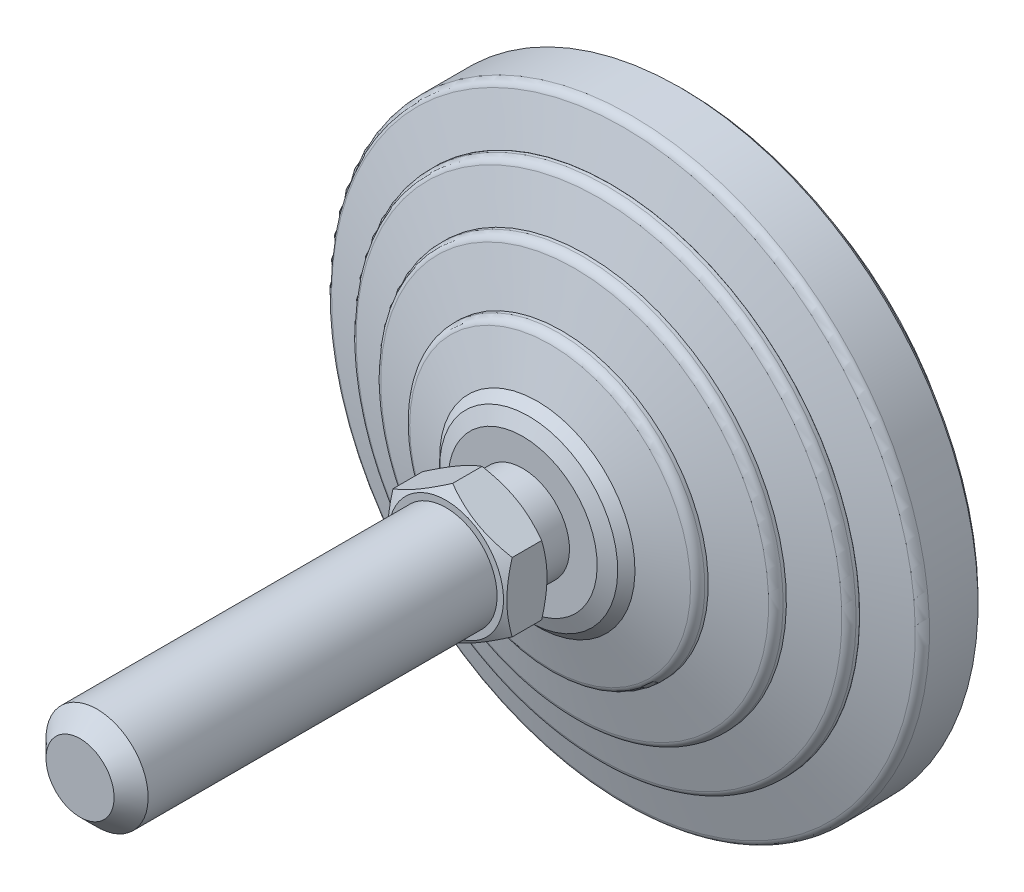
ISO-10303-21;
HEADER;
FILE_DESCRIPTION(('STEP AP214'),'2;1');
FILE_NAME('part.step','',(''),(''),'','','');
FILE_SCHEMA(('AUTOMOTIVE_DESIGN { 1 0 10303 214 1 1 1 1 }'));
ENDSEC;
DATA;
#1=APPLICATION_CONTEXT('core data for automotive mechanical design processes');
#2=APPLICATION_PROTOCOL_DEFINITION('international standard','automotive_design',2000,#1);
#3=PRODUCT_CONTEXT('',#1,'mechanical');
#4=PRODUCT('Part','Part','',(#3));
#5=PRODUCT_RELATED_PRODUCT_CATEGORY('part','',(#4));
#6=PRODUCT_DEFINITION_FORMATION('','',#4);
#7=PRODUCT_DEFINITION_CONTEXT('part definition',#1,'design');
#8=PRODUCT_DEFINITION('design','',#6,#7);
#9=PRODUCT_DEFINITION_SHAPE('','',#8);
#10=(LENGTH_UNIT() NAMED_UNIT(*) SI_UNIT(.MILLI.,.METRE.));
#11=(NAMED_UNIT(*) PLANE_ANGLE_UNIT() SI_UNIT($,.RADIAN.));
#12=(NAMED_UNIT(*) SI_UNIT($,.STERADIAN.) SOLID_ANGLE_UNIT());
#13=UNCERTAINTY_MEASURE_WITH_UNIT(LENGTH_MEASURE(1.E-05),#10,'distance_accuracy_value','');
#14=(GEOMETRIC_REPRESENTATION_CONTEXT(3) GLOBAL_UNCERTAINTY_ASSIGNED_CONTEXT((#13)) GLOBAL_UNIT_ASSIGNED_CONTEXT((#10,
#11,#12)) REPRESENTATION_CONTEXT('',''));
#15=CARTESIAN_POINT('',(0.,0.,0.));
#16=DIRECTION('',(0.,0.,1.));
#17=DIRECTION('',(1.,0.,0.));
#18=AXIS2_PLACEMENT_3D('',#15,#16,#17);
#19=CARTESIAN_POINT('',(-5.5,0.,26.));
#20=DIRECTION('',(0.,0.,1.));
#21=DIRECTION('',(0.,-1.,0.));
#22=AXIS2_PLACEMENT_3D('',#19,#20,#21);
#23=PLANE('',#22);
#24=CARTESIAN_POINT('',(0.,0.,26.));
#25=DIRECTION('',(0.,0.,-1.));
#26=DIRECTION('',(-1.,0.,0.));
#27=AXIS2_PLACEMENT_3D('',#24,#25,#26);
#28=CIRCLE('',#27,6.75);
#29=CARTESIAN_POINT('',(-6.75,0.,26.));
#30=VERTEX_POINT('',#29);
#31=EDGE_CURVE('E596',#30,#30,#28,.T.);
#32=ORIENTED_EDGE('',*,*,#31,.T.);
#33=EDGE_LOOP('',(#32));
#34=FACE_BOUND('',#33,.T.);
#35=CARTESIAN_POINT('',(0.,0.,26.));
#36=DIRECTION('',(0.,0.,-1.));
#37=DIRECTION('',(0.,1.,0.));
#38=AXIS2_PLACEMENT_3D('',#35,#36,#37);
#39=CIRCLE('',#38,5.5);
#40=CARTESIAN_POINT('',(0.,5.5,26.));
#41=VERTEX_POINT('',#40);
#42=EDGE_CURVE('E156',#41,#41,#39,.T.);
#43=ORIENTED_EDGE('',*,*,#42,.F.);
#44=EDGE_LOOP('',(#43));
#45=FACE_BOUND('',#44,.T.);
#46=ADVANCED_FACE('F14',(#34,#45),#23,.F.);
#47=CARTESIAN_POINT('',(0.,0.,0.));
#48=DIRECTION('',(0.,0.,-1.));
#49=DIRECTION('',(0.,1.,0.));
#50=AXIS2_PLACEMENT_3D('',#47,#48,#49);
#51=CYLINDRICAL_SURFACE('',#50,5.5);
#52=CARTESIAN_POINT('',(0.,0.,22.));
#53=DIRECTION('',(0.,0.,-1.));
#54=DIRECTION('',(0.,1.,0.));
#55=AXIS2_PLACEMENT_3D('',#52,#53,#54);
#56=CIRCLE('',#55,5.5);
#57=CARTESIAN_POINT('',(0.,5.5,22.));
#58=VERTEX_POINT('',#57);
#59=EDGE_CURVE('E153',#58,#58,#56,.T.);
#60=ORIENTED_EDGE('',*,*,#59,.F.);
#61=EDGE_LOOP('',(#60));
#62=FACE_BOUND('',#61,.T.);
#63=ORIENTED_EDGE('',*,*,#42,.T.);
#64=EDGE_LOOP('',(#63));
#65=FACE_BOUND('',#64,.T.);
#66=ADVANCED_FACE('F180',(#62,#65),#51,.T.);
#67=CARTESIAN_POINT('',(-8.7540983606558,0.,22.));
#68=DIRECTION('',(0.,0.,-1.));
#69=DIRECTION('',(0.,1.,0.));
#70=AXIS2_PLACEMENT_3D('',#67,#68,#69);
#71=PLANE('',#70);
#72=CARTESIAN_POINT('',(0.,0.,22.));
#73=DIRECTION('',(0.,0.,-1.));
#74=DIRECTION('',(0.,1.,0.));
#75=AXIS2_PLACEMENT_3D('',#72,#73,#74);
#76=CIRCLE('',#75,8.7540983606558);
#77=CARTESIAN_POINT('',(0.,8.7540983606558,22.));
#78=VERTEX_POINT('',#77);
#79=EDGE_CURVE('E150',#78,#78,#76,.T.);
#80=ORIENTED_EDGE('',*,*,#79,.F.);
#81=EDGE_LOOP('',(#80));
#82=FACE_BOUND('',#81,.T.);
#83=ORIENTED_EDGE('',*,*,#59,.T.);
#84=EDGE_LOOP('',(#83));
#85=FACE_BOUND('',#84,.T.);
#86=ADVANCED_FACE('F187',(#82,#85),#71,.F.);
#87=CARTESIAN_POINT('',(0.,0.,22.));
#88=DIRECTION('',(0.,0.,-1.));
#89=DIRECTION('',(0.,1.,0.));
#90=AXIS2_PLACEMENT_3D('',#87,#88,#89);
#91=CONICAL_SURFACE('',#90,8.7540983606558,1.17809724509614);
#92=CARTESIAN_POINT('',(0.,0.,21.2928932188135));
#93=DIRECTION('',(0.,0.,-1.));
#94=DIRECTION('',(0.,1.,0.));
#95=AXIS2_PLACEMENT_3D('',#92,#93,#94);
#96=CIRCLE('',#95,10.4612051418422);
#97=CARTESIAN_POINT('',(0.,10.4612051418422,21.2928932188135));
#98=VERTEX_POINT('',#97);
#99=EDGE_CURVE('E147',#98,#98,#96,.T.);
#100=ORIENTED_EDGE('',*,*,#99,.F.);
#101=EDGE_LOOP('',(#100));
#102=FACE_BOUND('',#101,.T.);
#103=ORIENTED_EDGE('',*,*,#79,.T.);
#104=EDGE_LOOP('',(#103));
#105=FACE_BOUND('',#104,.T.);
#106=ADVANCED_FACE('F459',(#102,#105),#91,.T.);
#107=CARTESIAN_POINT('',(0.,0.,21.2928932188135));
#108=DIRECTION('',(0.,0.,-1.));
#109=DIRECTION('',(0.,1.,0.));
#110=AXIS2_PLACEMENT_3D('',#107,#108,#109);
#111=CONICAL_SURFACE('',#110,10.4612051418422,0.785398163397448);
#112=CARTESIAN_POINT('',(0.,0.,20.2786885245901));
#113=DIRECTION('',(0.,0.,-1.));
#114=DIRECTION('',(0.,1.,0.));
#115=AXIS2_PLACEMENT_3D('',#112,#113,#114);
#116=CIRCLE('',#115,11.4754098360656);
#117=CARTESIAN_POINT('',(0.,11.4754098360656,20.2786885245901));
#118=VERTEX_POINT('',#117);
#119=EDGE_CURVE('E144',#118,#118,#116,.T.);
#120=ORIENTED_EDGE('',*,*,#119,.F.);
#121=EDGE_LOOP('',(#120));
#122=FACE_BOUND('',#121,.T.);
#123=ORIENTED_EDGE('',*,*,#99,.T.);
#124=EDGE_LOOP('',(#123));
#125=FACE_BOUND('',#124,.T.);
#126=ADVANCED_FACE('F449',(#122,#125),#111,.T.);
#127=CARTESIAN_POINT('',(0.,0.,20.2786885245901));
#128=DIRECTION('',(0.,0.,-1.));
#129=DIRECTION('',(0.,1.,0.));
#130=AXIS2_PLACEMENT_3D('',#127,#128,#129);
#131=CONICAL_SURFACE('',#130,11.4754098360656,1.27933953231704);
#132=CARTESIAN_POINT('',(0.,0.,18.7711726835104));
#133=DIRECTION('',(0.,0.,-1.));
#134=DIRECTION('',(0.,1.,0.));
#135=AXIS2_PLACEMENT_3D('',#132,#133,#134);
#136=CIRCLE('',#135,16.5004626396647);
#137=CARTESIAN_POINT('',(0.,16.5004626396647,18.7711726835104));
#138=VERTEX_POINT('',#137);
#139=EDGE_CURVE('E141',#138,#138,#136,.T.);
#140=ORIENTED_EDGE('',*,*,#139,.F.);
#141=EDGE_LOOP('',(#140));
#142=FACE_BOUND('',#141,.T.);
#143=ORIENTED_EDGE('',*,*,#119,.T.);
#144=EDGE_LOOP('',(#143));
#145=FACE_BOUND('',#144,.T.);
#146=ADVANCED_FACE('F439',(#142,#145),#131,.T.);
#147=CARTESIAN_POINT('',(0.,0.,17.8133463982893));
#148=DIRECTION('',(0.,0.,-1.));
#149=DIRECTION('',(0.,1.,0.));
#150=AXIS2_PLACEMENT_3D('',#147,#148,#149);
#151=TOROIDAL_SURFACE('',#150,16.2131147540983,1.);
#152=CARTESIAN_POINT('',(0.,0.,17.8133463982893));
#153=DIRECTION('',(0.,0.,-1.));
#154=DIRECTION('',(0.,1.,0.));
#155=AXIS2_PLACEMENT_3D('',#152,#153,#154);
#156=CIRCLE('',#155,17.2131147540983);
#157=CARTESIAN_POINT('',(0.,17.2131147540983,17.8133463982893));
#158=VERTEX_POINT('',#157);
#159=EDGE_CURVE('E138',#158,#158,#156,.T.);
#160=ORIENTED_EDGE('',*,*,#159,.F.);
#161=EDGE_LOOP('',(#160));
#162=FACE_BOUND('',#161,.T.);
#163=ORIENTED_EDGE('',*,*,#139,.T.);
#164=EDGE_LOOP('',(#163));
#165=FACE_BOUND('',#164,.T.);
#166=ADVANCED_FACE('F429',(#162,#165),#151,.T.);
#167=CARTESIAN_POINT('',(0.,0.,0.));
#168=DIRECTION('',(0.,0.,-1.));
#169=DIRECTION('',(0.,1.,0.));
#170=AXIS2_PLACEMENT_3D('',#167,#168,#169);
#171=CYLINDRICAL_SURFACE('',#170,17.2131147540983);
#172=CARTESIAN_POINT('',(0.,0.,17.4098360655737));
#173=DIRECTION('',(0.,0.,-1.));
#174=DIRECTION('',(0.,1.,0.));
#175=AXIS2_PLACEMENT_3D('',#172,#173,#174);
#176=CIRCLE('',#175,17.2131147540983);
#177=CARTESIAN_POINT('',(0.,17.2131147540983,17.4098360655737));
#178=VERTEX_POINT('',#177);
#179=EDGE_CURVE('E135',#178,#178,#176,.T.);
#180=ORIENTED_EDGE('',*,*,#179,.F.);
#181=EDGE_LOOP('',(#180));
#182=FACE_BOUND('',#181,.T.);
#183=ORIENTED_EDGE('',*,*,#159,.T.);
#184=EDGE_LOOP('',(#183));
#185=FACE_BOUND('',#184,.T.);
#186=ADVANCED_FACE('F419',(#182,#185),#171,.T.);
#187=CARTESIAN_POINT('',(0.,0.,17.4098360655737));
#188=DIRECTION('',(0.,0.,-1.));
#189=DIRECTION('',(0.,1.,0.));
#190=AXIS2_PLACEMENT_3D('',#187,#188,#189);
#191=CONICAL_SURFACE('',#190,17.2131147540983,1.30454427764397);
#192=CARTESIAN_POINT('',(0.,0.,15.8894925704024));
#193=DIRECTION('',(0.,0.,-1.));
#194=DIRECTION('',(0.,1.,0.));
#195=AXIS2_PLACEMENT_3D('',#192,#193,#194);
#196=CIRCLE('',#195,22.7877075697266);
#197=CARTESIAN_POINT('',(0.,22.7877075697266,15.8894925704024));
#198=VERTEX_POINT('',#197);
#199=EDGE_CURVE('E132',#198,#198,#196,.T.);
#200=ORIENTED_EDGE('',*,*,#199,.F.);
#201=EDGE_LOOP('',(#200));
#202=FACE_BOUND('',#201,.T.);
#203=ORIENTED_EDGE('',*,*,#179,.T.);
#204=EDGE_LOOP('',(#203));
#205=FACE_BOUND('',#204,.T.);
#206=ADVANCED_FACE('F409',(#202,#205),#191,.T.);
#207=CARTESIAN_POINT('',(0.,0.,14.9247287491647));
#208=DIRECTION('',(0.,0.,-1.));
#209=DIRECTION('',(0.,1.,0.));
#210=AXIS2_PLACEMENT_3D('',#207,#208,#209);
#211=TOROIDAL_SURFACE('',#210,22.5245901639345,1.);
#212=CARTESIAN_POINT('',(0.,0.,14.9247287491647));
#213=DIRECTION('',(0.,0.,-1.));
#214=DIRECTION('',(0.,1.,0.));
#215=AXIS2_PLACEMENT_3D('',#212,#213,#214);
#216=CIRCLE('',#215,23.5245901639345);
#217=CARTESIAN_POINT('',(0.,23.5245901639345,14.9247287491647));
#218=VERTEX_POINT('',#217);
#219=EDGE_CURVE('E129',#218,#218,#216,.T.);
#220=ORIENTED_EDGE('',*,*,#219,.F.);
#221=EDGE_LOOP('',(#220));
#222=FACE_BOUND('',#221,.T.);
#223=ORIENTED_EDGE('',*,*,#199,.T.);
#224=EDGE_LOOP('',(#223));
#225=FACE_BOUND('',#224,.T.);
#226=ADVANCED_FACE('F399',(#222,#225),#211,.T.);
#227=CARTESIAN_POINT('',(0.,0.,0.));
#228=DIRECTION('',(0.,0.,-1.));
#229=DIRECTION('',(0.,1.,0.));
#230=AXIS2_PLACEMENT_3D('',#227,#228,#229);
#231=CYLINDRICAL_SURFACE('',#230,23.5245901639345);
#232=CARTESIAN_POINT('',(0.,0.,14.5409836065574));
#233=DIRECTION('',(0.,0.,-1.));
#234=DIRECTION('',(0.,1.,0.));
#235=AXIS2_PLACEMENT_3D('',#232,#233,#234);
#236=CIRCLE('',#235,23.5245901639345);
#237=CARTESIAN_POINT('',(0.,23.5245901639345,14.5409836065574));
#238=VERTEX_POINT('',#237);
#239=EDGE_CURVE('E126',#238,#238,#236,.T.);
#240=ORIENTED_EDGE('',*,*,#239,.F.);
#241=EDGE_LOOP('',(#240));
#242=FACE_BOUND('',#241,.T.);
#243=ORIENTED_EDGE('',*,*,#219,.T.);
#244=EDGE_LOOP('',(#243));
#245=FACE_BOUND('',#244,.T.);
#246=ADVANCED_FACE('F389',(#242,#245),#231,.T.);
#247=CARTESIAN_POINT('',(0.,0.,14.5409836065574));
#248=DIRECTION('',(0.,0.,-1.));
#249=DIRECTION('',(0.,1.,0.));
#250=AXIS2_PLACEMENT_3D('',#247,#248,#249);
#251=CONICAL_SURFACE('',#250,23.5245901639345,1.27871257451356);
#252=CARTESIAN_POINT('',(0.,0.,13.0337743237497));
#253=DIRECTION('',(0.,0.,-1.));
#254=DIRECTION('',(0.,1.,0.));
#255=AXIS2_PLACEMENT_3D('',#252,#253,#254);
#256=CIRCLE('',#255,28.5372004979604);
#257=CARTESIAN_POINT('',(0.,28.5372004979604,13.0337743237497));
#258=VERTEX_POINT('',#257);
#259=EDGE_CURVE('E123',#258,#258,#256,.T.);
#260=ORIENTED_EDGE('',*,*,#259,.F.);
#261=EDGE_LOOP('',(#260));
#262=FACE_BOUND('',#261,.T.);
#263=ORIENTED_EDGE('',*,*,#239,.T.);
#264=EDGE_LOOP('',(#263));
#265=FACE_BOUND('',#264,.T.);
#266=ADVANCED_FACE('F379',(#262,#265),#251,.T.);
#267=CARTESIAN_POINT('',(0.,0.,12.0761283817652));
#268=DIRECTION('',(0.,0.,-1.));
#269=DIRECTION('',(0.,1.,0.));
#270=AXIS2_PLACEMENT_3D('',#267,#268,#269);
#271=TOROIDAL_SURFACE('',#270,28.2492521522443,0.999999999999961);
#272=CARTESIAN_POINT('',(0.,0.,12.0761283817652));
#273=DIRECTION('',(0.,0.,-1.));
#274=DIRECTION('',(0.,1.,0.));
#275=AXIS2_PLACEMENT_3D('',#272,#273,#274);
#276=CIRCLE('',#275,29.2492521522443);
#277=CARTESIAN_POINT('',(0.,29.2492521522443,12.0761283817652));
#278=VERTEX_POINT('',#277);
#279=EDGE_CURVE('E120',#278,#278,#276,.T.);
#280=ORIENTED_EDGE('',*,*,#279,.F.);
#281=EDGE_LOOP('',(#280));
#282=FACE_BOUND('',#281,.T.);
#283=ORIENTED_EDGE('',*,*,#259,.T.);
#284=EDGE_LOOP('',(#283));
#285=FACE_BOUND('',#284,.T.);
#286=ADVANCED_FACE('F369',(#282,#285),#271,.T.);
#287=CARTESIAN_POINT('',(0.,0.,0.));
#288=DIRECTION('',(0.,0.,-1.));
#289=DIRECTION('',(0.,1.,0.));
#290=AXIS2_PLACEMENT_3D('',#287,#288,#289);
#291=CYLINDRICAL_SURFACE('',#290,29.2492521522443);
#292=CARTESIAN_POINT('',(0.,0.,11.672131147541));
#293=DIRECTION('',(0.,0.,-1.));
#294=DIRECTION('',(0.,1.,0.));
#295=AXIS2_PLACEMENT_3D('',#292,#293,#294);
#296=CIRCLE('',#295,29.2492521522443);
#297=CARTESIAN_POINT('',(0.,29.2492521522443,11.672131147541));
#298=VERTEX_POINT('',#297);
#299=EDGE_CURVE('E117',#298,#298,#296,.T.);
#300=ORIENTED_EDGE('',*,*,#299,.F.);
#301=EDGE_LOOP('',(#300));
#302=FACE_BOUND('',#301,.T.);
#303=ORIENTED_EDGE('',*,*,#279,.T.);
#304=EDGE_LOOP('',(#303));
#305=FACE_BOUND('',#304,.T.);
#306=ADVANCED_FACE('F359',(#302,#305),#291,.T.);
#307=CARTESIAN_POINT('',(-29.2622950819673,0.,11.672131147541));
#308=DIRECTION('',(0.,0.,-1.));
#309=DIRECTION('',(0.,1.,0.));
#310=AXIS2_PLACEMENT_3D('',#307,#308,#309);
#311=PLANE('',#310);
#312=CARTESIAN_POINT('',(0.,0.,11.672131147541));
#313=DIRECTION('',(0.,0.,-1.));
#314=DIRECTION('',(0.,1.,0.));
#315=AXIS2_PLACEMENT_3D('',#312,#313,#314);
#316=CIRCLE('',#315,29.2622950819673);
#317=CARTESIAN_POINT('',(0.,29.2622950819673,11.672131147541));
#318=VERTEX_POINT('',#317);
#319=EDGE_CURVE('E114',#318,#318,#316,.T.);
#320=ORIENTED_EDGE('',*,*,#319,.F.);
#321=EDGE_LOOP('',(#320));
#322=FACE_BOUND('',#321,.T.);
#323=ORIENTED_EDGE('',*,*,#299,.T.);
#324=EDGE_LOOP('',(#323));
#325=FACE_BOUND('',#324,.T.);
#326=ADVANCED_FACE('F349',(#322,#325),#311,.F.);
#327=CARTESIAN_POINT('',(0.,0.,11.672131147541));
#328=DIRECTION('',(0.,0.,-1.));
#329=DIRECTION('',(0.,1.,0.));
#330=AXIS2_PLACEMENT_3D('',#327,#328,#329);
#331=CONICAL_SURFACE('',#330,29.2622950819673,1.27933953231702);
#332=CARTESIAN_POINT('',(0.,0.,10.1646153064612));
#333=DIRECTION('',(0.,0.,-1.));
#334=DIRECTION('',(0.,1.,0.));
#335=AXIS2_PLACEMENT_3D('',#332,#333,#334);
#336=CIRCLE('',#335,34.2873478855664);
#337=CARTESIAN_POINT('',(0.,34.2873478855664,10.1646153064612));
#338=VERTEX_POINT('',#337);
#339=EDGE_CURVE('E111',#338,#338,#336,.T.);
#340=ORIENTED_EDGE('',*,*,#339,.F.);
#341=EDGE_LOOP('',(#340));
#342=FACE_BOUND('',#341,.T.);
#343=ORIENTED_EDGE('',*,*,#319,.T.);
#344=EDGE_LOOP('',(#343));
#345=FACE_BOUND('',#344,.T.);
#346=ADVANCED_FACE('F339',(#342,#345),#331,.T.);
#347=CARTESIAN_POINT('',(0.,0.,9.20678902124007));
#348=DIRECTION('',(0.,0.,-1.));
#349=DIRECTION('',(0.,1.,0.));
#350=AXIS2_PLACEMENT_3D('',#347,#348,#349);
#351=TOROIDAL_SURFACE('',#350,34.,1.);
#352=CARTESIAN_POINT('',(0.,0.,9.20678902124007));
#353=DIRECTION('',(0.,0.,-1.));
#354=DIRECTION('',(0.,1.,0.));
#355=AXIS2_PLACEMENT_3D('',#352,#353,#354);
#356=CIRCLE('',#355,35.);
#357=CARTESIAN_POINT('',(0.,35.,9.20678902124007));
#358=VERTEX_POINT('',#357);
#359=EDGE_CURVE('E108',#358,#358,#356,.T.);
#360=ORIENTED_EDGE('',*,*,#359,.F.);
#361=EDGE_LOOP('',(#360));
#362=FACE_BOUND('',#361,.T.);
#363=ORIENTED_EDGE('',*,*,#339,.T.);
#364=EDGE_LOOP('',(#363));
#365=FACE_BOUND('',#364,.T.);
#366=ADVANCED_FACE('F329',(#362,#365),#351,.T.);
#367=CARTESIAN_POINT('',(0.,0.,0.));
#368=DIRECTION('',(0.,0.,-1.));
#369=DIRECTION('',(0.,1.,0.));
#370=AXIS2_PLACEMENT_3D('',#367,#368,#369);
#371=CYLINDRICAL_SURFACE('',#370,35.);
#372=CARTESIAN_POINT('',(0.,0.,3.5));
#373=DIRECTION('',(0.,0.,-1.));
#374=DIRECTION('',(0.,1.,0.));
#375=AXIS2_PLACEMENT_3D('',#372,#373,#374);
#376=CIRCLE('',#375,35.);
#377=CARTESIAN_POINT('',(0.,35.,3.5));
#378=VERTEX_POINT('',#377);
#379=EDGE_CURVE('E105',#378,#378,#376,.T.);
#380=ORIENTED_EDGE('',*,*,#379,.F.);
#381=EDGE_LOOP('',(#380));
#382=FACE_BOUND('',#381,.T.);
#383=ORIENTED_EDGE('',*,*,#359,.T.);
#384=EDGE_LOOP('',(#383));
#385=FACE_BOUND('',#384,.T.);
#386=ADVANCED_FACE('F319',(#382,#385),#371,.T.);
#387=CARTESIAN_POINT('',(0.,0.,3.5));
#388=DIRECTION('',(0.,0.,1.));
#389=DIRECTION('',(0.,-1.,0.));
#390=AXIS2_PLACEMENT_3D('',#387,#388,#389);
#391=CONICAL_SURFACE('',#390,35.,0.785398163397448);
#392=CARTESIAN_POINT('',(0.,0.,3.));
#393=DIRECTION('',(0.,0.,-1.));
#394=DIRECTION('',(0.,1.,0.));
#395=AXIS2_PLACEMENT_3D('',#392,#393,#394);
#396=CIRCLE('',#395,34.5);
#397=CARTESIAN_POINT('',(0.,34.5,3.));
#398=VERTEX_POINT('',#397);
#399=EDGE_CURVE('E102',#398,#398,#396,.T.);
#400=ORIENTED_EDGE('',*,*,#399,.F.);
#401=EDGE_LOOP('',(#400));
#402=FACE_BOUND('',#401,.T.);
#403=ORIENTED_EDGE('',*,*,#379,.T.);
#404=EDGE_LOOP('',(#403));
#405=FACE_BOUND('',#404,.T.);
#406=ADVANCED_FACE('F309',(#402,#405),#391,.T.);
#407=CARTESIAN_POINT('',(-34.5,0.,3.));
#408=DIRECTION('',(0.,0.,1.));
#409=DIRECTION('',(0.,-1.,0.));
#410=AXIS2_PLACEMENT_3D('',#407,#408,#409);
#411=PLANE('',#410);
#412=CARTESIAN_POINT('',(0.,0.,3.));
#413=DIRECTION('',(0.,0.,-1.));
#414=DIRECTION('',(0.,1.,0.));
#415=AXIS2_PLACEMENT_3D('',#412,#413,#414);
#416=CIRCLE('',#415,30.4098360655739);
#417=CARTESIAN_POINT('',(0.,30.4098360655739,3.));
#418=VERTEX_POINT('',#417);
#419=EDGE_CURVE('E99',#418,#418,#416,.T.);
#420=ORIENTED_EDGE('',*,*,#419,.F.);
#421=EDGE_LOOP('',(#420));
#422=FACE_BOUND('',#421,.T.);
#423=ORIENTED_EDGE('',*,*,#399,.T.);
#424=EDGE_LOOP('',(#423));
#425=FACE_BOUND('',#424,.T.);
#426=ADVANCED_FACE('F299',(#422,#425),#411,.F.);
#427=CARTESIAN_POINT('',(0.,0.,0.));
#428=DIRECTION('',(0.,0.,-1.));
#429=DIRECTION('',(0.,1.,0.));
#430=AXIS2_PLACEMENT_3D('',#427,#428,#429);
#431=CYLINDRICAL_SURFACE('',#430,30.4098360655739);
#432=CARTESIAN_POINT('',(0.,0.,0.));
#433=DIRECTION('',(0.,0.,-1.));
#434=DIRECTION('',(0.,1.,0.));
#435=AXIS2_PLACEMENT_3D('',#432,#433,#434);
#436=CIRCLE('',#435,30.4098360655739);
#437=CARTESIAN_POINT('',(0.,30.4098360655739,0.));
#438=VERTEX_POINT('',#437);
#439=EDGE_CURVE('E96',#438,#438,#436,.T.);
#440=ORIENTED_EDGE('',*,*,#439,.F.);
#441=EDGE_LOOP('',(#440));
#442=FACE_BOUND('',#441,.T.);
#443=ORIENTED_EDGE('',*,*,#419,.T.);
#444=EDGE_LOOP('',(#443));
#445=FACE_BOUND('',#444,.T.);
#446=ADVANCED_FACE('F288',(#442,#445),#431,.T.);
#447=CARTESIAN_POINT('',(-30.4098360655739,0.,0.));
#448=DIRECTION('',(0.,0.,1.));
#449=DIRECTION('',(0.,-1.,0.));
#450=AXIS2_PLACEMENT_3D('',#447,#448,#449);
#451=PLANE('',#450);
#452=ORIENTED_EDGE('',*,*,#439,.T.);
#453=EDGE_LOOP('',(#452));
#454=FACE_BOUND('',#453,.T.);
#455=ADVANCED_FACE('F178',(#454),#451,.F.);
#456=CARTESIAN_POINT('',(0.,0.,27.4929339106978));
#457=DIRECTION('',(0.,0.,1.));
#458=DIRECTION('',(1.,0.,0.));
#459=AXIS2_PLACEMENT_3D('',#456,#457,#458);
#460=CONICAL_SURFACE('',#459,9.33583738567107,1.0471975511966);
#461=CARTESIAN_POINT('',(0.256690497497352,-8.2311040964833,26.8574261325));
#462=CARTESIAN_POINT('',(-0.0699427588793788,-8.04252229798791,26.7427099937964));
#463=CARTESIAN_POINT('',(-0.399630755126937,-7.8521768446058,26.6377184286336));
#464=CARTESIAN_POINT('',(-1.06538523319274,-7.46780331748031,26.4533978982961));
#465=CARTESIAN_POINT('',(-1.40146857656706,-7.27376550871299,26.3741510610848));
#466=CARTESIAN_POINT('',(-1.90417470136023,-6.98352799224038,26.2806949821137));
#467=CARTESIAN_POINT('',(-2.06905004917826,-6.88833716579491,26.2539985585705));
#468=CARTESIAN_POINT('',(-2.39966363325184,-6.69745732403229,26.2089558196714));
#469=CARTESIAN_POINT('',(-2.56540187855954,-6.60176830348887,26.1906095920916));
#470=CARTESIAN_POINT('',(-2.89717147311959,-6.41022103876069,26.1627907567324));
#471=CARTESIAN_POINT('',(-3.06320191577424,-6.31436331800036,26.1533038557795));
#472=CARTESIAN_POINT('',(-3.39546669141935,-6.12253016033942,26.1434237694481));
#473=CARTESIAN_POINT('',(-3.56170102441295,-6.02655472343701,26.143030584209));
#474=CARTESIAN_POINT('',(-3.90438826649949,-5.8287041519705,26.1516119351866));
#475=CARTESIAN_POINT('',(-4.08083025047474,-5.72683532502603,26.1611736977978));
#476=CARTESIAN_POINT('',(-4.43309489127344,-5.52345523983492,26.1902705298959));
#477=CARTESIAN_POINT('',(-4.60891752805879,-5.42194399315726,26.2098059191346));
#478=CARTESIAN_POINT('',(-4.95991222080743,-5.21929711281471,26.2582999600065));
#479=CARTESIAN_POINT('',(-5.13508243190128,-5.11816254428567,26.2872762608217));
#480=CARTESIAN_POINT('',(-5.48419291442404,-4.91660351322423,26.3538480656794));
#481=CARTESIAN_POINT('',(-5.65813309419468,-4.81617910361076,26.3914442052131));
#482=CARTESIAN_POINT('',(-6.01015077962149,-4.61294159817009,26.4756805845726));
#483=CARTESIAN_POINT('',(-6.18818303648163,-4.51015462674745,26.5225712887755));
#484=CARTESIAN_POINT('',(-6.54271452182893,-4.30546577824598,26.6235750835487));
#485=CARTESIAN_POINT('',(-6.71921358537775,-4.20356399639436,26.6776889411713));
#486=CARTESIAN_POINT('',(-7.06994522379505,-4.00106899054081,26.7919351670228));
#487=CARTESIAN_POINT('',(-7.2441841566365,-3.90047209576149,26.8520416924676));
#488=CARTESIAN_POINT('',(-7.59114355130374,-3.70015499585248,26.9775972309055));
#489=CARTESIAN_POINT('',(-7.76386456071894,-3.60043447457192,27.0430442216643));
#490=CARTESIAN_POINT('',(-7.93589615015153,-3.50111199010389,27.1107539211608));
#491=B_SPLINE_CURVE_WITH_KNOTS('',3,(#461,#462,#463,#464,#465,#466,#467,#468,#469,#470,#471,
#472,#473,#474,#475,#476,#477,#478,#479,#480,#481,#482,#483,#484,#485,#486,#487,#488,#489,#490),
.UNSPECIFIED.,.F.,.F.,(4,2,2,2,2,2,2,2,2,2,2,2,2,2,4),(0.,1.1834150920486,2.37056913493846,
2.94713316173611,3.52370324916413,4.09934151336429,4.67497978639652,5.28660816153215,
5.89825614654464,6.51105419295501,7.12389743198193,7.75631027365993,8.38879032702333,
9.01865204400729,9.64827635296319),.UNSPECIFIED.);
#492=CARTESIAN_POINT('',(0.,-8.08290376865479,26.7695523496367));
#493=VERTEX_POINT('',#492);
#494=CARTESIAN_POINT('',(-7.,-4.04145188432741,26.7695523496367));
#495=VERTEX_POINT('',#494);
#496=EDGE_CURVE('E73',#493,#495,#491,.T.);
#497=ORIENTED_EDGE('',*,*,#496,.T.);
#498=CARTESIAN_POINT('',(-7.,-10.7990491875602,29.5329925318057));
#499=CARTESIAN_POINT('',(-7.,-10.4937832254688,29.385140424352));
#500=CARTESIAN_POINT('',(-7.,-10.1878103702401,29.2387225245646));
#501=CARTESIAN_POINT('',(-7.,-9.57407471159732,28.9495629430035));
#502=CARTESIAN_POINT('',(-7.,-9.26631163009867,28.8068218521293));
#503=CARTESIAN_POINT('',(-7.,-8.64700625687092,28.5250933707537));
#504=CARTESIAN_POINT('',(-7.,-8.33545247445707,28.3861311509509));
#505=CARTESIAN_POINT('',(-7.,-7.70984697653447,28.1139699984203));
#506=CARTESIAN_POINT('',(-7.,-7.39579538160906,27.9807707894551));
#507=CARTESIAN_POINT('',(-7.,-6.75478230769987,27.7175894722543));
#508=CARTESIAN_POINT('',(-7.,-6.42772498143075,27.5878395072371));
#509=CARTESIAN_POINT('',(-7.,-5.76976386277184,27.3382977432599));
#510=CARTESIAN_POINT('',(-7.,-5.43885964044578,27.2185070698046));
#511=CARTESIAN_POINT('',(-7.,-4.77331220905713,26.992070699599));
#512=CARTESIAN_POINT('',(-7.,-4.43867832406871,26.8853978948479));
#513=CARTESIAN_POINT('',(-7.,-3.7646232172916,26.688656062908));
#514=CARTESIAN_POINT('',(-7.,-3.42520355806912,26.5985817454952));
#515=CARTESIAN_POINT('',(-7.,-2.74319850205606,26.4398784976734));
#516=CARTESIAN_POINT('',(-7.,-2.40064038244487,26.3711355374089));
#517=CARTESIAN_POINT('',(-7.,-1.88372972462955,26.287024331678));
#518=CARTESIAN_POINT('',(-7.,-1.71090079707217,26.2621533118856));
#519=CARTESIAN_POINT('',(-7.,-1.36440335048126,26.2192347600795));
#520=CARTESIAN_POINT('',(-7.,-1.19073491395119,26.2011865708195));
#521=CARTESIAN_POINT('',(-7.,-0.845034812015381,26.1724966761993));
#522=CARTESIAN_POINT('',(-7.,-0.673010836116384,26.1617626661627));
#523=CARTESIAN_POINT('',(-7.,-0.328663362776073,26.1475748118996));
#524=CARTESIAN_POINT('',(-7.,-0.156339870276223,26.1441208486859));
#525=CARTESIAN_POINT('',(-7.,0.188299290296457,26.1445753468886));
#526=CARTESIAN_POINT('',(-7.,0.360614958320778,26.1484838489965));
#527=CARTESIAN_POINT('',(-7.,0.704930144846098,26.1635687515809));
#528=CARTESIAN_POINT('',(-7.,0.876929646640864,26.1747455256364));
#529=CARTESIAN_POINT('',(-7.,1.29203383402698,26.2102558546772));
#530=CARTESIAN_POINT('',(-7.,1.53484148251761,26.2381343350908));
#531=CARTESIAN_POINT('',(-7.,2.01860570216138,26.3068413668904));
#532=CARTESIAN_POINT('',(-7.,2.25956200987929,26.3476717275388));
#533=CARTESIAN_POINT('',(-7.,2.97940593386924,26.4874213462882));
#534=CARTESIAN_POINT('',(-7.,3.4549897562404,26.6035721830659));
#535=CARTESIAN_POINT('',(-7.,4.16604143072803,26.8043707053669));
#536=CARTESIAN_POINT('',(-7.,4.40521285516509,26.8766525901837));
#537=CARTESIAN_POINT('',(-7.,4.88123167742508,27.0285698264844));
#538=CARTESIAN_POINT('',(-7.,5.11807906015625,27.1082052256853));
#539=CARTESIAN_POINT('',(-7.,5.58952730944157,27.2735646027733));
#540=CARTESIAN_POINT('',(-7.,5.82412892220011,27.3592864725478));
#541=CARTESIAN_POINT('',(-7.,6.2913988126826,27.5358255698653));
#542=CARTESIAN_POINT('',(-7.,6.52406711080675,27.6266427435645));
#543=CARTESIAN_POINT('',(-7.,7.06382466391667,27.8430499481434));
#544=CARTESIAN_POINT('',(-7.,7.37026109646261,27.9702650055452));
#545=CARTESIAN_POINT('',(-7.,7.98060822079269,28.230632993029));
#546=CARTESIAN_POINT('',(-7.,8.28451877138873,28.3637862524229));
#547=CARTESIAN_POINT('',(-7.,8.89026663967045,28.6348640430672));
#548=CARTESIAN_POINT('',(-7.,9.19210356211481,28.7727894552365));
#549=CARTESIAN_POINT('',(-7.,9.79399721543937,29.05247801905));
#550=CARTESIAN_POINT('',(-7.,10.0940539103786,29.1942412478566));
#551=CARTESIAN_POINT('',(-7.,10.6929672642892,29.4810411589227));
#552=CARTESIAN_POINT('',(-7.,10.9918224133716,29.6260809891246));
#553=CARTESIAN_POINT('',(-7.,11.5882632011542,29.9187501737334));
#554=CARTESIAN_POINT('',(-7.,11.8858488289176,30.0663795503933));
#555=CARTESIAN_POINT('',(-7.,12.7769255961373,30.5124401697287));
#556=CARTESIAN_POINT('',(-7.,13.3688106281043,30.814079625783));
#557=CARTESIAN_POINT('',(-7.,14.5014973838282,31.3986676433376));
#558=CARTESIAN_POINT('',(-7.,15.0425436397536,31.6811444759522));
#559=CARTESIAN_POINT('',(-7.,16.1226186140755,32.2499687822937));
#560=CARTESIAN_POINT('',(-7.,16.661647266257,32.5363163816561));
#561=CARTESIAN_POINT('',(-7.,17.7368539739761,33.1112901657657));
#562=CARTESIAN_POINT('',(-7.,18.2730357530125,33.3999093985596));
#563=CARTESIAN_POINT('',(-7.,19.3441038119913,33.979476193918));
#564=CARTESIAN_POINT('',(-7.,19.8789901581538,34.2704236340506));
#565=CARTESIAN_POINT('',(-7.,20.4133969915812,34.5622433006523));
#566=B_SPLINE_CURVE_WITH_KNOTS('',3,(#498,#499,#500,#501,#502,#503,#504,#505,#506,#507,#508,
#509,#510,#511,#512,#513,#514,#515,#516,#517,#518,#519,#520,#521,#522,#523,#524,#525,#526,#527,
#528,#529,#530,#531,#532,#533,#534,#535,#536,#537,#538,#539,#540,#541,#542,#543,#544,#545,#546,
#547,#548,#549,#550,#551,#552,#553,#554,#555,#556,#557,#558,#559,#560,#561,#562,#563,#564,#565),
.UNSPECIFIED.,.F.,.F.,(4,2,2,2,2,2,2,2,2,2,2,2,2,2,2,2,2,2,2,2,2,2,2,2,2,2,2,2,2,2,2,2,2,4),(0.,
1.0175725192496,2.03530756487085,3.05867976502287,4.08200285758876,5.1374403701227,
6.19299699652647,7.24633429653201,8.29933529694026,9.34660629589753,9.87032066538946,
10.3939845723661,10.9109109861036,11.4278289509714,11.944749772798,12.461697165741,
13.1944905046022,13.9273862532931,15.3940142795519,16.1435194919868,16.8930295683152,
17.6422812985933,18.3915251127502,19.3868224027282,20.3821749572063,21.377712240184,
22.3732695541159,23.3698278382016,24.36639469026,26.3592818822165,28.1903079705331,
30.0213936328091,31.8481682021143,33.6748473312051),.UNSPECIFIED.);
#567=CARTESIAN_POINT('',(-7.,4.04145188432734,26.7695523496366));
#568=VERTEX_POINT('',#567);
#569=EDGE_CURVE('E81',#495,#568,#566,.T.);
#570=ORIENTED_EDGE('',*,*,#569,.T.);
#571=CARTESIAN_POINT('',(-12.681652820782,0.761148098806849,29.4378172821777));
#572=CARTESIAN_POINT('',(-12.4130849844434,0.916205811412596,29.2884477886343));
#573=CARTESIAN_POINT('',(-12.1438632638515,1.07164104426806,29.1406158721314));
#574=CARTESIAN_POINT('',(-11.6037511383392,1.38347492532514,28.8489235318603));
#575=CARTESIAN_POINT('',(-11.3328604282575,1.53987374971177,28.7050638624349));
#576=CARTESIAN_POINT('',(-10.7874331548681,1.85477633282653,28.4213761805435));
#577=CARTESIAN_POINT('',(-10.5128843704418,2.01328714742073,28.2815793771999));
#578=CARTESIAN_POINT('',(-9.96144966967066,2.33165812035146,28.0082986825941));
#579=CARTESIAN_POINT('',(-9.68456388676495,2.49151820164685,27.8748144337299));
#580=CARTESIAN_POINT('',(-9.12543907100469,2.81432906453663,27.6146948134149));
#581=CARTESIAN_POINT('',(-8.84317424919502,2.97729473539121,27.4881329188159));
#582=CARTESIAN_POINT('',(-8.27521177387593,3.30520802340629,27.24552175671));
#583=CARTESIAN_POINT('',(-7.98951371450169,3.47015587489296,27.1294737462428));
#584=CARTESIAN_POINT('',(-7.41489136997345,3.80191424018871,26.9112471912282));
#585=CARTESIAN_POINT('',(-7.12597653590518,3.96871929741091,26.8090358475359));
#586=CARTESIAN_POINT('',(-6.54400340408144,4.30472164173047,26.6220300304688));
#587=CARTESIAN_POINT('',(-6.2509465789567,4.4739180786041,26.5372295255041));
#588=CARTESIAN_POINT('',(-5.66496176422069,4.81223656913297,26.3905735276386));
#589=CARTESIAN_POINT('',(-5.37209550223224,4.98132298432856,26.3283983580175));
#590=CARTESIAN_POINT('',(-4.93039634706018,5.23633811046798,26.2542266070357));
#591=CARTESIAN_POINT('',(-4.78274380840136,5.32158534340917,26.2326829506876));
#592=CARTESIAN_POINT('',(-4.48681864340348,5.49243781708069,26.1963863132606));
#593=CARTESIAN_POINT('',(-4.33854607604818,5.5780430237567,26.181632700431));
#594=CARTESIAN_POINT('',(-4.04242221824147,5.74901021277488,26.1593043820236));
#595=CARTESIAN_POINT('',(-3.89457316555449,5.83437090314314,26.1516902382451));
#596=CARTESIAN_POINT('',(-3.59872938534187,6.00517638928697,26.1436724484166));
#597=CARTESIAN_POINT('',(-3.45073465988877,6.09062118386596,26.1432687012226));
#598=CARTESIAN_POINT('',(-3.15489967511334,6.26142159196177,26.1496811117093));
#599=CARTESIAN_POINT('',(-3.0070593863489,6.34677722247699,26.1564954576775));
#600=CARTESIAN_POINT('',(-2.71174735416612,6.51727570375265,26.1771827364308));
#601=CARTESIAN_POINT('',(-2.564275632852,6.60241854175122,26.1910560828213));
#602=CARTESIAN_POINT('',(-2.20025100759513,6.81258825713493,26.2337356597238));
#603=CARTESIAN_POINT('',(-1.98404015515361,6.93741765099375,26.2665018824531));
#604=CARTESIAN_POINT('',(-1.55345117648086,7.18601831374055,26.3453246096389));
#605=CARTESIAN_POINT('',(-1.33907335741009,7.30978940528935,26.3913832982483));
#606=CARTESIAN_POINT('',(-0.698245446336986,7.67977157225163,26.5471685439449));
#607=CARTESIAN_POINT('',(-0.274955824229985,7.92415794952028,26.6743917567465));
#608=CARTESIAN_POINT('',(0.357851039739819,8.28950916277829,26.8917340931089));
#609=CARTESIAN_POINT('',(0.570713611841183,8.41240542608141,26.9695876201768));
#610=CARTESIAN_POINT('',(0.994383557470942,8.6570113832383,27.1325554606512));
#611=CARTESIAN_POINT('',(1.20519075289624,8.77872097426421,27.2176703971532));
#612=CARTESIAN_POINT('',(1.62369230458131,9.02034295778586,27.3933761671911));
#613=CARTESIAN_POINT('',(1.83139759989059,9.14026166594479,27.483932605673));
#614=CARTESIAN_POINT('',(2.24507372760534,9.37909768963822,27.6699632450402));
#615=CARTESIAN_POINT('',(2.45104511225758,9.49801532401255,27.7654358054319));
#616=CARTESIAN_POINT('',(2.65629167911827,9.61651448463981,27.8628983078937));
#617=B_SPLINE_CURVE_WITH_KNOTS('',3,(#571,#572,#573,#574,#575,#576,#577,#578,#579,#580,#581,
#582,#583,#584,#585,#586,#587,#588,#589,#590,#591,#592,#593,#594,#595,#596,#597,#598,#599,#600,
#601,#602,#603,#604,#605,#606,#607,#608,#609,#610,#611,#612,#613,#614,#615,#616),.UNSPECIFIED.,
.F.,.F.,(4,2,2,2,2,2,2,2,2,2,2,2,2,2,2,2,2,2,2,2,2,2,4),(0.,1.03265523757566,2.06550524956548,
3.10487986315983,4.14419552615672,5.19297996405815,6.24188962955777,7.28826765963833,
8.3342825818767,9.36488478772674,9.88032113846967,10.3957095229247,10.9082338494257,
11.4207509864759,11.9331395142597,12.4455580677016,13.2005232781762,13.955612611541,
15.468758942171,16.2421889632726,17.0156854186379,17.784722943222,18.5535054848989),.UNSPECIFIED.);
#618=CARTESIAN_POINT('',(0.,8.08290376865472,26.7695523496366));
#619=VERTEX_POINT('',#618);
#620=EDGE_CURVE('E551',#568,#619,#617,.T.);
#621=ORIENTED_EDGE('',*,*,#620,.T.);
#622=CARTESIAN_POINT('',(-0.942488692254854,8.62704986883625,27.1133505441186));
#623=CARTESIAN_POINT('',(-0.770363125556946,8.52767312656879,27.0455383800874));
#624=CARTESIAN_POINT('',(-0.597547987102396,8.42789825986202,26.9799872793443));
#625=CARTESIAN_POINT('',(-0.250399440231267,8.22747195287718,26.8542206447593));
#626=CARTESIAN_POINT('',(-0.0760654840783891,8.12682019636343,26.7940071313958));
#627=CARTESIAN_POINT('',(0.27485965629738,7.92421347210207,26.6795435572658));
#628=CARTESIAN_POINT('',(0.451457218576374,7.82225482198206,26.6253193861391));
#629=CARTESIAN_POINT('',(0.806187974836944,7.61745092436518,26.5240937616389));
#630=CARTESIAN_POINT('',(0.984321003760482,7.51460577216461,26.4770915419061));
#631=CARTESIAN_POINT('',(1.33653694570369,7.31125380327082,26.3926369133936));
#632=CARTESIAN_POINT('',(1.51057448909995,7.21077318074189,26.3549338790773));
#633=CARTESIAN_POINT('',(1.8598832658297,7.00909966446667,26.2881508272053));
#634=CARTESIAN_POINT('',(2.03515440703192,6.9079068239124,26.2590701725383));
#635=CARTESIAN_POINT('',(2.38635445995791,6.70514137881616,26.2103731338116));
#636=CARTESIAN_POINT('',(2.56228151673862,6.60356984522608,26.190739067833));
#637=CARTESIAN_POINT('',(2.91475917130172,6.40006677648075,26.1614536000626));
#638=CARTESIAN_POINT('',(3.09130974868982,6.29813525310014,26.151801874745));
#639=CARTESIAN_POINT('',(3.43402627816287,6.10026777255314,26.1430621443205));
#640=CARTESIAN_POINT('',(3.60018089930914,6.00433835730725,26.1433760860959));
#641=CARTESIAN_POINT('',(3.93228973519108,5.81259523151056,26.1530902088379));
#642=CARTESIAN_POINT('',(4.09824394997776,5.71678152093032,26.1624903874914));
#643=CARTESIAN_POINT('',(4.42986410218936,5.52532053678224,26.1901307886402));
#644=CARTESIAN_POINT('',(4.59552914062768,5.42967378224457,26.2083852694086));
#645=CARTESIAN_POINT('',(4.92599972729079,5.23887650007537,26.2532421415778));
#646=CARTESIAN_POINT('',(5.0908052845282,5.1437259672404,26.2798444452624));
#647=CARTESIAN_POINT('',(5.59329460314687,4.85361362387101,26.3730112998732));
#648=CARTESIAN_POINT('',(5.9292357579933,4.65965790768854,26.4520624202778));
#649=CARTESIAN_POINT('',(6.59471674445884,4.27544228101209,26.6360022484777));
#650=CARTESIAN_POINT('',(6.92427336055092,4.0851726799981,26.7408090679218));
#651=CARTESIAN_POINT('',(7.25077590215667,3.89666634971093,26.8553503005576));
#652=B_SPLINE_CURVE_WITH_KNOTS('',3,(#622,#623,#624,#625,#626,#627,#628,#629,#630,#631,#632,
#633,#634,#635,#636,#637,#638,#639,#640,#641,#642,#643,#644,#645,#646,#647,#648,#649,#650,#651),
.UNSPECIFIED.,.F.,.F.,(4,2,2,2,2,2,2,2,2,2,2,2,2,2,4),(0.,0.630031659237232,1.26030079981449,
1.89319572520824,2.52602344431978,3.13925728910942,3.75244581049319,4.36448207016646,
4.97649849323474,5.55186054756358,6.12722245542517,6.70351397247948,7.27979943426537,
8.4663526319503,9.64918100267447),.UNSPECIFIED.);
#653=CARTESIAN_POINT('',(7.,4.04145188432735,26.7695523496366));
#654=VERTEX_POINT('',#653);
#655=EDGE_CURVE('E546',#619,#654,#652,.T.);
#656=ORIENTED_EDGE('',*,*,#655,.T.);
#657=CARTESIAN_POINT('',(7.,-10.7990491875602,29.5329925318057));
#658=CARTESIAN_POINT('',(7.,-10.4937832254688,29.385140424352));
#659=CARTESIAN_POINT('',(7.,-10.1878103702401,29.2387225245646));
#660=CARTESIAN_POINT('',(7.,-9.57407471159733,28.9495629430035));
#661=CARTESIAN_POINT('',(7.,-9.26631163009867,28.8068218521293));
#662=CARTESIAN_POINT('',(7.,-8.64700625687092,28.5250933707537));
#663=CARTESIAN_POINT('',(7.,-8.33545247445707,28.3861311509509));
#664=CARTESIAN_POINT('',(7.,-7.70984697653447,28.1139699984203));
#665=CARTESIAN_POINT('',(7.,-7.39579538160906,27.9807707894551));
#666=CARTESIAN_POINT('',(7.,-6.75478230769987,27.7175894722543));
#667=CARTESIAN_POINT('',(7.,-6.42772498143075,27.5878395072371));
#668=CARTESIAN_POINT('',(7.,-5.76976386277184,27.3382977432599));
#669=CARTESIAN_POINT('',(7.,-5.43885964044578,27.2185070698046));
#670=CARTESIAN_POINT('',(7.,-4.77331220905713,26.992070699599));
#671=CARTESIAN_POINT('',(7.,-4.43867832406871,26.8853978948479));
#672=CARTESIAN_POINT('',(7.,-3.7646232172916,26.688656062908));
#673=CARTESIAN_POINT('',(7.,-3.42520355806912,26.5985817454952));
#674=CARTESIAN_POINT('',(7.,-2.74319850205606,26.4398784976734));
#675=CARTESIAN_POINT('',(7.,-2.40064038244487,26.3711355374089));
#676=CARTESIAN_POINT('',(7.,-1.88372972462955,26.287024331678));
#677=CARTESIAN_POINT('',(7.,-1.71090079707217,26.2621533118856));
#678=CARTESIAN_POINT('',(7.,-1.36440335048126,26.2192347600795));
#679=CARTESIAN_POINT('',(7.,-1.19073491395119,26.2011865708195));
#680=CARTESIAN_POINT('',(7.,-0.84503481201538,26.1724966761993));
#681=CARTESIAN_POINT('',(7.,-0.673010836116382,26.1617626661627));
#682=CARTESIAN_POINT('',(7.,-0.328663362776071,26.1475748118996));
#683=CARTESIAN_POINT('',(7.,-0.156339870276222,26.1441208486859));
#684=CARTESIAN_POINT('',(7.,0.188299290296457,26.1445753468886));
#685=CARTESIAN_POINT('',(7.,0.360614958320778,26.1484838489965));
#686=CARTESIAN_POINT('',(7.,0.704930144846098,26.1635687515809));
#687=CARTESIAN_POINT('',(7.,0.876929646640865,26.1747455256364));
#688=CARTESIAN_POINT('',(7.,1.29203383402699,26.2102558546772));
#689=CARTESIAN_POINT('',(7.,1.53484148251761,26.2381343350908));
#690=CARTESIAN_POINT('',(7.,2.01860570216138,26.3068413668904));
#691=CARTESIAN_POINT('',(7.,2.25956200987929,26.3476717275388));
#692=CARTESIAN_POINT('',(7.,2.97940593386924,26.4874213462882));
#693=CARTESIAN_POINT('',(7.,3.4549897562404,26.6035721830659));
#694=CARTESIAN_POINT('',(7.,4.16604143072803,26.8043707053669));
#695=CARTESIAN_POINT('',(7.,4.40521285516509,26.8766525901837));
#696=CARTESIAN_POINT('',(7.,4.88123167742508,27.0285698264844));
#697=CARTESIAN_POINT('',(7.,5.11807906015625,27.1082052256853));
#698=CARTESIAN_POINT('',(7.,5.58952730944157,27.2735646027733));
#699=CARTESIAN_POINT('',(7.,5.82412892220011,27.3592864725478));
#700=CARTESIAN_POINT('',(7.,6.2913988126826,27.5358255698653));
#701=CARTESIAN_POINT('',(7.,6.52406711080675,27.6266427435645));
#702=CARTESIAN_POINT('',(7.,7.06382466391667,27.8430499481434));
#703=CARTESIAN_POINT('',(7.,7.3702610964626,27.9702650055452));
#704=CARTESIAN_POINT('',(7.,7.98060822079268,28.230632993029));
#705=CARTESIAN_POINT('',(7.,8.28451877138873,28.3637862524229));
#706=CARTESIAN_POINT('',(7.,8.89026663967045,28.6348640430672));
#707=CARTESIAN_POINT('',(7.,9.19210356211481,28.7727894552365));
#708=CARTESIAN_POINT('',(7.,9.79399721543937,29.05247801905));
#709=CARTESIAN_POINT('',(7.,10.0940539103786,29.1942412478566));
#710=CARTESIAN_POINT('',(7.,10.6929672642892,29.4810411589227));
#711=CARTESIAN_POINT('',(7.,10.9918224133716,29.6260809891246));
#712=CARTESIAN_POINT('',(7.,11.5882632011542,29.9187501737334));
#713=CARTESIAN_POINT('',(7.,11.8858488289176,30.0663795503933));
#714=CARTESIAN_POINT('',(7.,12.7769255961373,30.5124401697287));
#715=CARTESIAN_POINT('',(7.,13.3688106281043,30.814079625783));
#716=CARTESIAN_POINT('',(7.,14.5014973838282,31.3986676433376));
#717=CARTESIAN_POINT('',(7.,15.0425436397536,31.6811444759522));
#718=CARTESIAN_POINT('',(7.,16.1226186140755,32.2499687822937));
#719=CARTESIAN_POINT('',(7.,16.661647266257,32.5363163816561));
#720=CARTESIAN_POINT('',(7.,17.7368539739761,33.1112901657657));
#721=CARTESIAN_POINT('',(7.,18.2730357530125,33.3999093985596));
#722=CARTESIAN_POINT('',(7.,19.3441038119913,33.979476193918));
#723=CARTESIAN_POINT('',(7.,19.8789901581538,34.2704236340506));
#724=CARTESIAN_POINT('',(7.,20.4133969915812,34.5622433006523));
#725=B_SPLINE_CURVE_WITH_KNOTS('',3,(#657,#658,#659,#660,#661,#662,#663,#664,#665,#666,#667,
#668,#669,#670,#671,#672,#673,#674,#675,#676,#677,#678,#679,#680,#681,#682,#683,#684,#685,#686,
#687,#688,#689,#690,#691,#692,#693,#694,#695,#696,#697,#698,#699,#700,#701,#702,#703,#704,#705,
#706,#707,#708,#709,#710,#711,#712,#713,#714,#715,#716,#717,#718,#719,#720,#721,#722,#723,#724),
.UNSPECIFIED.,.F.,.F.,(4,2,2,2,2,2,2,2,2,2,2,2,2,2,2,2,2,2,2,2,2,2,2,2,2,2,2,2,2,2,2,2,2,4),(0.,
1.0175725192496,2.03530756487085,3.05867976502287,4.08200285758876,5.1374403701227,
6.19299699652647,7.24633429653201,8.29933529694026,9.34660629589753,9.87032066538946,
10.3939845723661,10.9109109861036,11.4278289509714,11.944749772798,12.461697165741,
13.1944905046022,13.9273862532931,15.3940142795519,16.1435194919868,16.8930295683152,
17.6422812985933,18.3915251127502,19.3868224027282,20.3821749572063,21.377712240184,
22.3732695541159,23.3698278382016,24.36639469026,26.3592818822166,28.1903079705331,
30.0213936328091,31.8481682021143,33.6748473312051),.UNSPECIFIED.);
#726=CARTESIAN_POINT('',(7.,-4.04145188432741,26.7695523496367));
#727=VERTEX_POINT('',#726);
#728=EDGE_CURVE('E34',#654,#727,#725,.F.);
#729=ORIENTED_EDGE('',*,*,#728,.T.);
#730=CARTESIAN_POINT('',(-5.68637638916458,-11.3659347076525,29.4404454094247));
#731=CARTESIAN_POINT('',(-5.41783918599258,-11.2108946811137,29.2910695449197));
#732=CARTESIAN_POINT('',(-5.14864888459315,-11.0554775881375,29.1432292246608));
#733=CARTESIAN_POINT('',(-4.60860177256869,-10.7436812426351,28.8515143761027));
#734=CARTESIAN_POINT('',(-4.33774465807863,-10.5873018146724,28.7076405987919));
#735=CARTESIAN_POINT('',(-3.79239226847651,-10.2724424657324,28.4239196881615));
#736=CARTESIAN_POINT('',(-3.51788482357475,-10.1139555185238,28.2841036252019));
#737=CARTESIAN_POINT('',(-2.96653588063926,-9.79563405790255,28.0107739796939));
#738=CARTESIAN_POINT('',(-2.68969451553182,-9.63579962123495,27.8772600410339));
#739=CARTESIAN_POINT('',(-2.13063028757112,-9.31302373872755,27.6170517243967));
#740=CARTESIAN_POINT('',(-1.84838133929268,-9.15006723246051,27.4904316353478));
#741=CARTESIAN_POINT('',(-1.28045390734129,-8.8221741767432,27.2476878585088));
#742=CARTESIAN_POINT('',(-0.994775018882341,-8.65723739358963,27.1315654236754));
#743=CARTESIAN_POINT('',(-0.420191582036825,-8.32550149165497,26.913168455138));
#744=CARTESIAN_POINT('',(-0.131296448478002,-8.15870780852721,26.8108612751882));
#745=CARTESIAN_POINT('',(0.450636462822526,-7.82272868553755,26.6236386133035));
#746=CARTESIAN_POINT('',(0.743672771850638,-7.65354409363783,26.5387171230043));
#747=CARTESIAN_POINT('',(1.32970591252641,-7.31519770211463,26.3917720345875));
#748=CARTESIAN_POINT('',(1.62264219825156,-7.14607085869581,26.3294354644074));
#749=CARTESIAN_POINT('',(2.06445318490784,-6.89099116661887,26.2550166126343));
#750=CARTESIAN_POINT('',(2.21214408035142,-6.80572178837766,26.2333897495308));
#751=CARTESIAN_POINT('',(2.50814864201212,-6.6348234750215,26.196926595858));
#752=CARTESIAN_POINT('',(2.65646224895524,-6.5491945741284,26.1820896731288));
#753=CARTESIAN_POINT('',(2.95266683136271,-6.37818077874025,26.1595971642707));
#754=CARTESIAN_POINT('',(3.10055554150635,-6.29279719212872,26.1519019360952));
#755=CARTESIAN_POINT('',(3.3964815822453,-6.12194421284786,26.1437251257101));
#756=CARTESIAN_POINT('',(3.54451891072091,-6.03647482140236,26.1432434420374));
#757=CARTESIAN_POINT('',(3.84044168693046,-5.86562372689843,26.1495049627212));
#758=CARTESIAN_POINT('',(3.98832716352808,-5.78024200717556,26.156246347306));
#759=CARTESIAN_POINT('',(4.28373184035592,-5.60969003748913,26.1767941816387));
#760=CARTESIAN_POINT('',(4.43125101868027,-5.52451980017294,26.1906010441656));
#761=CARTESIAN_POINT('',(4.79515746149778,-5.31441831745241,26.2330978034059));
#762=CARTESIAN_POINT('',(5.01120505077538,-5.18968318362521,26.265736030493));
#763=CARTESIAN_POINT('',(5.44147356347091,-4.94126754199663,26.3442932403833));
#764=CARTESIAN_POINT('',(5.65569418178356,-4.81758721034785,26.3902143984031));
#765=CARTESIAN_POINT('',(6.29605681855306,-4.44787366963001,26.545580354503));
#766=CARTESIAN_POINT('',(6.71904591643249,-4.20366080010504,26.67251570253));
#767=CARTESIAN_POINT('',(7.35141668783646,-3.83856136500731,26.8894322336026));
#768=CARTESIAN_POINT('',(7.564140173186,-3.71574540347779,26.9671456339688));
#769=CARTESIAN_POINT('',(7.98753317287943,-3.47129934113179,27.1298365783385));
#770=CARTESIAN_POINT('',(8.19820250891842,-3.34966934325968,27.214814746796));
#771=CARTESIAN_POINT('',(8.6164304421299,-3.10820533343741,27.3902518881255));
#772=CARTESIAN_POINT('',(8.82399996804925,-2.98836501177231,27.4806764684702));
#773=CARTESIAN_POINT('',(9.23740451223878,-2.74968578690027,27.6664470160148));
#774=CARTESIAN_POINT('',(9.44324008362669,-2.63084656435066,27.7617913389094));
#775=CARTESIAN_POINT('',(9.6483506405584,-2.5124259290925,27.8591273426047));
#776=B_SPLINE_CURVE_WITH_KNOTS('',3,(#730,#731,#732,#733,#734,#735,#736,#737,#738,#739,#740,
#741,#742,#743,#744,#745,#746,#747,#748,#749,#750,#751,#752,#753,#754,#755,#756,#757,#758,#759,
#760,#761,#762,#763,#764,#765,#766,#767,#768,#769,#770,#771,#772,#773,#774,#775),.UNSPECIFIED.,
.F.,.F.,(4,2,2,2,2,2,2,2,2,2,2,2,2,2,2,2,2,2,2,2,2,2,4),(0.,1.03256787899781,2.06532993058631,
3.10459699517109,4.14380526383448,5.1926020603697,6.24152387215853,7.28792194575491,
8.33395777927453,9.36488712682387,9.88048668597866,10.3960382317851,10.9087106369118,
11.4213758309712,11.9339118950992,12.4464779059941,13.2008329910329,13.9553116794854,
15.4672323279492,16.2400759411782,17.0129860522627,17.7814437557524,18.5496462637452),.UNSPECIFIED.);
#777=EDGE_CURVE('E9',#727,#493,#776,.F.);
#778=ORIENTED_EDGE('',*,*,#777,.T.);
#779=EDGE_LOOP('',(#497,#570,#621,#656,#729,#778));
#780=FACE_BOUND('',#779,.T.);
#781=ORIENTED_EDGE('',*,*,#31,.F.);
#782=EDGE_LOOP('',(#781));
#783=FACE_BOUND('',#782,.T.);
#784=ADVANCED_FACE('F71',(#780,#783),#460,.T.);
#785=CARTESIAN_POINT('',(-3.99999999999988,0.,74.));
#786=DIRECTION('',(0.,0.,-1.));
#787=DIRECTION('',(0.,1.,0.));
#788=AXIS2_PLACEMENT_3D('',#785,#786,#787);
#789=PLANE('',#788);
#790=CARTESIAN_POINT('',(0.,0.,74.));
#791=DIRECTION('',(0.,0.,-1.));
#792=DIRECTION('',(0.,1.,0.));
#793=AXIS2_PLACEMENT_3D('',#790,#791,#792);
#794=CIRCLE('',#793,3.99999999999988);
#795=CARTESIAN_POINT('',(0.,3.99999999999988,74.));
#796=VERTEX_POINT('',#795);
#797=EDGE_CURVE('E28',#796,#796,#794,.T.);
#798=ORIENTED_EDGE('',*,*,#797,.F.);
#799=EDGE_LOOP('',(#798));
#800=FACE_BOUND('',#799,.T.);
#801=ADVANCED_FACE('F16',(#800),#789,.F.);
#802=CARTESIAN_POINT('',(0.,0.,74.));
#803=DIRECTION('',(0.,0.,-1.));
#804=DIRECTION('',(0.,1.,0.));
#805=AXIS2_PLACEMENT_3D('',#802,#803,#804);
#806=CONICAL_SURFACE('',#805,3.99999999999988,0.785398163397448);
#807=CARTESIAN_POINT('',(0.,0.,72.));
#808=DIRECTION('',(0.,0.,-1.));
#809=DIRECTION('',(0.,1.,0.));
#810=AXIS2_PLACEMENT_3D('',#807,#808,#809);
#811=CIRCLE('',#810,5.99999999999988);
#812=CARTESIAN_POINT('',(0.,5.99999999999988,72.));
#813=VERTEX_POINT('',#812);
#814=EDGE_CURVE('E162',#813,#813,#811,.T.);
#815=ORIENTED_EDGE('',*,*,#814,.F.);
#816=EDGE_LOOP('',(#815));
#817=FACE_BOUND('',#816,.T.);
#818=ORIENTED_EDGE('',*,*,#797,.T.);
#819=EDGE_LOOP('',(#818));
#820=FACE_BOUND('',#819,.T.);
#821=ADVANCED_FACE('F167',(#817,#820),#806,.T.);
#822=CARTESIAN_POINT('',(0.,0.,0.));
#823=DIRECTION('',(0.,0.,-1.));
#824=DIRECTION('',(0.,1.,0.));
#825=AXIS2_PLACEMENT_3D('',#822,#823,#824);
#826=CYLINDRICAL_SURFACE('',#825,5.99999999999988);
#827=CARTESIAN_POINT('',(0.,0.,31.));
#828=DIRECTION('',(0.,0.,-1.));
#829=DIRECTION('',(0.,1.,0.));
#830=AXIS2_PLACEMENT_3D('',#827,#828,#829);
#831=CIRCLE('',#830,5.99999999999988);
#832=CARTESIAN_POINT('',(0.,5.99999999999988,31.));
#833=VERTEX_POINT('',#832);
#834=EDGE_CURVE('E159',#833,#833,#831,.T.);
#835=ORIENTED_EDGE('',*,*,#834,.F.);
#836=EDGE_LOOP('',(#835));
#837=FACE_BOUND('',#836,.T.);
#838=ORIENTED_EDGE('',*,*,#814,.T.);
#839=EDGE_LOOP('',(#838));
#840=FACE_BOUND('',#839,.T.);
#841=ADVANCED_FACE('F176',(#837,#840),#826,.T.);
#842=CARTESIAN_POINT('',(-5.99999999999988,0.,31.));
#843=DIRECTION('',(0.,0.,-1.));
#844=DIRECTION('',(0.,1.,0.));
#845=AXIS2_PLACEMENT_3D('',#842,#843,#844);
#846=PLANE('',#845);
#847=CARTESIAN_POINT('',(0.,0.,31.));
#848=DIRECTION('',(0.,0.,-1.));
#849=DIRECTION('',(-1.,0.,0.));
#850=AXIS2_PLACEMENT_3D('',#847,#848,#849);
#851=CIRCLE('',#850,6.75);
#852=CARTESIAN_POINT('',(-6.75,0.,31.));
#853=VERTEX_POINT('',#852);
#854=EDGE_CURVE('E80',#853,#853,#851,.T.);
#855=ORIENTED_EDGE('',*,*,#854,.F.);
#856=EDGE_LOOP('',(#855));
#857=FACE_BOUND('',#856,.T.);
#858=ORIENTED_EDGE('',*,*,#834,.T.);
#859=EDGE_LOOP('',(#858));
#860=FACE_BOUND('',#859,.T.);
#861=ADVANCED_FACE('F194',(#857,#860),#846,.F.);
#862=CARTESIAN_POINT('',(0.,0.,31.));
#863=DIRECTION('',(0.,0.,-1.));
#864=DIRECTION('',(-1.,0.,0.));
#865=AXIS2_PLACEMENT_3D('',#862,#863,#864);
#866=CONICAL_SURFACE('',#865,6.75,1.0471975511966);
#867=CARTESIAN_POINT('',(-7.93589615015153,-3.50111199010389,29.8892460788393));
#868=CARTESIAN_POINT('',(-7.76386456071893,-3.60043447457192,29.9569557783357));
#869=CARTESIAN_POINT('',(-7.59114355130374,-3.70015499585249,30.0224027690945));
#870=CARTESIAN_POINT('',(-7.2441841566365,-3.90047209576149,30.1479583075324));
#871=CARTESIAN_POINT('',(-7.06994522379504,-4.00106899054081,30.2080648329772));
#872=CARTESIAN_POINT('',(-6.71921358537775,-4.20356399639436,30.3223110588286));
#873=CARTESIAN_POINT('',(-6.54271452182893,-4.30546577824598,30.3764249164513));
#874=CARTESIAN_POINT('',(-6.18818303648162,-4.51015462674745,30.4774287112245));
#875=CARTESIAN_POINT('',(-6.01015077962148,-4.61294159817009,30.5243194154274));
#876=CARTESIAN_POINT('',(-5.65813309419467,-4.81617910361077,30.6085557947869));
#877=CARTESIAN_POINT('',(-5.48419291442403,-4.91660351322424,30.6461519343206));
#878=CARTESIAN_POINT('',(-5.13508243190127,-5.11816254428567,30.7127237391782));
#879=CARTESIAN_POINT('',(-4.95991222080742,-5.21929711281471,30.7417000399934));
#880=CARTESIAN_POINT('',(-4.60891752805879,-5.42194399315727,30.7901940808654));
#881=CARTESIAN_POINT('',(-4.43309489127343,-5.52345523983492,30.809729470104));
#882=CARTESIAN_POINT('',(-4.08083025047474,-5.72683532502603,30.8388263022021));
#883=CARTESIAN_POINT('',(-3.90438826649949,-5.8287041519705,30.8483880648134));
#884=CARTESIAN_POINT('',(-3.56170102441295,-6.02655472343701,30.856969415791));
#885=CARTESIAN_POINT('',(-3.39546669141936,-6.12253016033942,30.8565762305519));
#886=CARTESIAN_POINT('',(-3.06320191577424,-6.31436331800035,30.8466961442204));
#887=CARTESIAN_POINT('',(-2.89717147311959,-6.41022103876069,30.8372092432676));
#888=CARTESIAN_POINT('',(-2.56540187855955,-6.60176830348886,30.8093904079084));
#889=CARTESIAN_POINT('',(-2.39966363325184,-6.69745732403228,30.7910441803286));
#890=CARTESIAN_POINT('',(-2.06905004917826,-6.88833716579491,30.7460014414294));
#891=CARTESIAN_POINT('',(-1.90417470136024,-6.98352799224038,30.7193050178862));
#892=CARTESIAN_POINT('',(-1.40146857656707,-7.27376550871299,30.6258489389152));
#893=CARTESIAN_POINT('',(-1.06538523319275,-7.46780331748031,30.5466021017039));
#894=CARTESIAN_POINT('',(-0.399630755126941,-7.8521768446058,30.3622815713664));
#895=CARTESIAN_POINT('',(-0.0699427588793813,-8.04252229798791,30.2572900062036));
#896=CARTESIAN_POINT('',(0.256690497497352,-8.2311040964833,30.1425738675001));
#897=B_SPLINE_CURVE_WITH_KNOTS('',3,(#867,#868,#869,#870,#871,#872,#873,#874,#875,#876,#877,
#878,#879,#880,#881,#882,#883,#884,#885,#886,#887,#888,#889,#890,#891,#892,#893,#894,#895,#896),
.UNSPECIFIED.,.F.,.F.,(4,2,2,2,2,2,2,2,2,2,2,2,2,2,4),(0.,0.629624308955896,1.25948602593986,
1.89196607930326,2.52437892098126,3.13722216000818,3.75002020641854,4.36166819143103,
4.97329656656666,5.54893483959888,6.12457310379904,6.70114319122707,7.27770721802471,
8.46486126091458,9.64827635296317),.UNSPECIFIED.);
#898=CARTESIAN_POINT('',(-7.,-4.04145188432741,30.2304476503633));
#899=VERTEX_POINT('',#898);
#900=CARTESIAN_POINT('',(0.,-8.08290376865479,30.2304476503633));
#901=VERTEX_POINT('',#900);
#902=EDGE_CURVE('E88',#899,#901,#897,.T.);
#903=ORIENTED_EDGE('',*,*,#902,.T.);
#904=CARTESIAN_POINT('',(-5.68637638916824,-11.3659347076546,27.5595545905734));
#905=CARTESIAN_POINT('',(-5.41783918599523,-11.2108946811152,27.7089304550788));
#906=CARTESIAN_POINT('',(-5.14864888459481,-11.0554775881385,27.8567707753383));
#907=CARTESIAN_POINT('',(-4.60860177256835,-10.7436812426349,28.1484856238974));
#908=CARTESIAN_POINT('',(-4.3377446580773,-10.5873018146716,28.2923594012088));
#909=CARTESIAN_POINT('',(-3.7923922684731,-10.2724424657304,28.5760803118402));
#910=CARTESIAN_POINT('',(-3.51788482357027,-10.1139555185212,28.7158963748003));
#911=CARTESIAN_POINT('',(-2.96653588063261,-9.79563405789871,28.9892260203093));
#912=CARTESIAN_POINT('',(-2.68969451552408,-9.63579962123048,29.1227399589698));
#913=CARTESIAN_POINT('',(-2.13063028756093,-9.31302373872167,29.3829482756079));
#914=CARTESIAN_POINT('',(-1.84838133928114,-9.15006723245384,29.5095683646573));
#915=CARTESIAN_POINT('',(-1.28045390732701,-8.82217417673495,29.7523121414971));
#916=CARTESIAN_POINT('',(-0.994775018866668,-8.65723739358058,29.8684345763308));
#917=CARTESIAN_POINT('',(-0.420191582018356,-8.32550149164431,30.0868315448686));
#918=CARTESIAN_POINT('',(-0.131296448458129,-8.15870780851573,30.1891387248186));
#919=CARTESIAN_POINT('',(0.450636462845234,-7.82272868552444,30.3763613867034));
#920=CARTESIAN_POINT('',(0.743672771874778,-7.6535440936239,30.4612828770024));
#921=CARTESIAN_POINT('',(1.32970591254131,-7.31519770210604,30.6082279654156));
#922=CARTESIAN_POINT('',(1.62264219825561,-7.14607085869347,30.6705645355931));
#923=CARTESIAN_POINT('',(2.06445318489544,-6.89099116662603,30.7449833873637));
#924=CARTESIAN_POINT('',(2.21214408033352,-6.805721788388,30.7666102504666));
#925=CARTESIAN_POINT('',(2.50814864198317,-6.63482347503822,30.8030734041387));
#926=CARTESIAN_POINT('',(2.65646224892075,-6.54919457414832,30.8179103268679));
#927=CARTESIAN_POINT('',(2.95266683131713,-6.37818077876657,30.8404028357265));
#928=CARTESIAN_POINT('',(3.10055554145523,-6.29279719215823,30.8480980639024));
#929=CARTESIAN_POINT('',(3.39648158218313,-6.12194421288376,30.8562748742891));
#930=CARTESIAN_POINT('',(3.54451891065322,-6.03647482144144,30.8567565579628));
#931=CARTESIAN_POINT('',(3.84044168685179,-5.86562372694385,30.8504950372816));
#932=CARTESIAN_POINT('',(3.98832716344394,-5.78024200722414,30.8437536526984));
#933=CARTESIAN_POINT('',(4.28373184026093,-5.60969003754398,30.8232058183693));
#934=CARTESIAN_POINT('',(4.43125101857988,-5.52451980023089,30.8093989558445));
#935=CARTESIAN_POINT('',(4.79515746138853,-5.31441831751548,30.7669021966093));
#936=CARTESIAN_POINT('',(5.0112050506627,-5.18968318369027,30.7342639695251));
#937=CARTESIAN_POINT('',(5.44147356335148,-4.94126754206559,30.6557067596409));
#938=CARTESIAN_POINT('',(5.65569418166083,-4.81758721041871,30.6097856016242));
#939=CARTESIAN_POINT('',(6.29605681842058,-4.44787366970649,30.4544196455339));
#940=CARTESIAN_POINT('',(6.71904591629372,-4.20366080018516,30.3274842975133));
#941=CARTESIAN_POINT('',(7.3514166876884,-3.83856136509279,30.1105677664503));
#942=CARTESIAN_POINT('',(7.56414017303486,-3.71574540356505,30.0328543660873));
#943=CARTESIAN_POINT('',(7.98753317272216,-3.47129934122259,29.8701634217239));
#944=CARTESIAN_POINT('',(8.19820250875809,-3.34966934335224,29.7851852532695));
#945=CARTESIAN_POINT('',(8.6164304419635,-3.10820533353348,29.609748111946));
#946=CARTESIAN_POINT('',(8.82399996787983,-2.98836501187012,29.5193235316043));
#947=CARTESIAN_POINT('',(9.23740451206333,-2.74968578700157,29.3335529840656));
#948=CARTESIAN_POINT('',(9.44324008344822,-2.6308465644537,29.2382086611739));
#949=CARTESIAN_POINT('',(9.64835064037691,-2.51242592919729,29.1408726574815));
#950=B_SPLINE_CURVE_WITH_KNOTS('',3,(#904,#905,#906,#907,#908,#909,#910,#911,#912,#913,#914,
#915,#916,#917,#918,#919,#920,#921,#922,#923,#924,#925,#926,#927,#928,#929,#930,#931,#932,#933,
#934,#935,#936,#937,#938,#939,#940,#941,#942,#943,#944,#945,#946,#947,#948,#949),.UNSPECIFIED.,
.F.,.F.,(4,2,2,2,2,2,2,2,2,2,2,2,2,2,2,2,2,2,2,2,2,2,4),(0.,1.03256787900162,2.06532993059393,
3.10459699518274,4.14380526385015,5.19260206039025,6.24152387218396,7.28792194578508,
8.33395777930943,9.36488712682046,9.88048668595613,10.3960382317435,10.9087106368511,
11.4213758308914,11.9339118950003,12.4464779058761,13.2008329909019,13.9553116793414,
15.4672323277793,16.2400759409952,17.0129860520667,17.7814437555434,18.5496462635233),.UNSPECIFIED.);
#951=CARTESIAN_POINT('',(7.,-4.04145188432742,30.2304476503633));
#952=VERTEX_POINT('',#951);
#953=EDGE_CURVE('E86',#901,#952,#950,.T.);
#954=ORIENTED_EDGE('',*,*,#953,.T.);
#955=CARTESIAN_POINT('',(7.,-10.7990491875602,27.4670074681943));
#956=CARTESIAN_POINT('',(7.,-10.4937832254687,27.614859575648));
#957=CARTESIAN_POINT('',(7.,-10.1878103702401,27.7612774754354));
#958=CARTESIAN_POINT('',(7.,-9.5740747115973,28.0504370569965));
#959=CARTESIAN_POINT('',(7.,-9.26631163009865,28.1931781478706));
#960=CARTESIAN_POINT('',(7.,-8.6470062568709,28.4749066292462));
#961=CARTESIAN_POINT('',(7.,-8.33545247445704,28.6138688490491));
#962=CARTESIAN_POINT('',(7.,-7.70984697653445,28.8860300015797));
#963=CARTESIAN_POINT('',(7.,-7.39579538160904,29.0192292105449));
#964=CARTESIAN_POINT('',(7.,-6.75478230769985,29.2824105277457));
#965=CARTESIAN_POINT('',(7.,-6.42772498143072,29.4121604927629));
#966=CARTESIAN_POINT('',(7.,-5.76976386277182,29.6617022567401));
#967=CARTESIAN_POINT('',(7.,-5.43885964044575,29.7814929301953));
#968=CARTESIAN_POINT('',(7.,-4.77331220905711,30.0079293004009));
#969=CARTESIAN_POINT('',(7.,-4.43867832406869,30.1146021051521));
#970=CARTESIAN_POINT('',(7.,-3.76462321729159,30.311343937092));
#971=CARTESIAN_POINT('',(7.,-3.42520355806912,30.4014182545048));
#972=CARTESIAN_POINT('',(7.,-2.74319850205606,30.5601215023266));
#973=CARTESIAN_POINT('',(7.,-2.40064038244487,30.6288644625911));
#974=CARTESIAN_POINT('',(7.,-1.88372972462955,30.7129756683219));
#975=CARTESIAN_POINT('',(7.,-1.71090079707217,30.7378466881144));
#976=CARTESIAN_POINT('',(7.,-1.36440335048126,30.7807652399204));
#977=CARTESIAN_POINT('',(7.,-1.19073491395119,30.7988134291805));
#978=CARTESIAN_POINT('',(7.,-0.845034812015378,30.8275033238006));
#979=CARTESIAN_POINT('',(7.,-0.673010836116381,30.8382373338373));
#980=CARTESIAN_POINT('',(7.,-0.32866336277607,30.8524251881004));
#981=CARTESIAN_POINT('',(7.,-0.15633987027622,30.8558791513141));
#982=CARTESIAN_POINT('',(7.,0.188299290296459,30.8554246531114));
#983=CARTESIAN_POINT('',(7.,0.360614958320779,30.8515161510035));
#984=CARTESIAN_POINT('',(7.,0.704930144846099,30.8364312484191));
#985=CARTESIAN_POINT('',(7.,0.876929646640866,30.8252544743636));
#986=CARTESIAN_POINT('',(7.,1.29203383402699,30.7897441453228));
#987=CARTESIAN_POINT('',(7.,1.5348414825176,30.7618656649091));
#988=CARTESIAN_POINT('',(7.,2.01860570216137,30.6931586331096));
#989=CARTESIAN_POINT('',(7.,2.25956200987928,30.6523282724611));
#990=CARTESIAN_POINT('',(7.,2.97940593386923,30.5125786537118));
#991=CARTESIAN_POINT('',(7.,3.45498975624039,30.3964278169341));
#992=CARTESIAN_POINT('',(7.,4.16604143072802,30.1956292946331));
#993=CARTESIAN_POINT('',(7.,4.40521285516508,30.1233474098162));
#994=CARTESIAN_POINT('',(7.,4.88123167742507,29.9714301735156));
#995=CARTESIAN_POINT('',(7.,5.11807906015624,29.8917947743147));
#996=CARTESIAN_POINT('',(7.,5.58952730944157,29.7264353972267));
#997=CARTESIAN_POINT('',(7.,5.8241289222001,29.6407135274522));
#998=CARTESIAN_POINT('',(7.,6.29139881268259,29.4641744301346));
#999=CARTESIAN_POINT('',(7.,6.52406711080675,29.3733572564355));
#1000=CARTESIAN_POINT('',(7.,7.06382466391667,29.1569500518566));
#1001=CARTESIAN_POINT('',(7.,7.37026109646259,29.0297349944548));
#1002=CARTESIAN_POINT('',(7.,7.98060822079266,28.7693670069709));
#1003=CARTESIAN_POINT('',(7.,8.28451877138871,28.6362137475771));
#1004=CARTESIAN_POINT('',(7.,8.89026663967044,28.3651359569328));
#1005=CARTESIAN_POINT('',(7.,9.19210356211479,28.2272105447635));
#1006=CARTESIAN_POINT('',(7.,9.79399721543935,27.94752198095));
#1007=CARTESIAN_POINT('',(7.,10.0940539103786,27.8057587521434));
#1008=CARTESIAN_POINT('',(7.,10.6929672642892,27.5189588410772));
#1009=CARTESIAN_POINT('',(7.,10.9918224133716,27.3739190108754));
#1010=CARTESIAN_POINT('',(7.,11.5882632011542,27.0812498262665));
#1011=CARTESIAN_POINT('',(7.,11.8858488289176,26.9336204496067));
#1012=CARTESIAN_POINT('',(7.,12.7769255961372,26.4875598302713));
#1013=CARTESIAN_POINT('',(7.,13.3688106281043,26.1859203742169));
#1014=CARTESIAN_POINT('',(7.,14.5014973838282,25.6013323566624));
#1015=CARTESIAN_POINT('',(7.,15.0425436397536,25.3188555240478));
#1016=CARTESIAN_POINT('',(7.,16.1226186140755,24.7500312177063));
#1017=CARTESIAN_POINT('',(7.,16.661647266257,24.4636836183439));
#1018=CARTESIAN_POINT('',(7.,17.7368539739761,23.8887098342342));
#1019=CARTESIAN_POINT('',(7.,18.2730357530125,23.6000906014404));
#1020=CARTESIAN_POINT('',(7.,19.3441038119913,23.020523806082));
#1021=CARTESIAN_POINT('',(7.,19.8789901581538,22.7295763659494));
#1022=CARTESIAN_POINT('',(7.,20.4133969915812,22.4377566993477));
#1023=B_SPLINE_CURVE_WITH_KNOTS('',3,(#955,#956,#957,#958,#959,#960,#961,#962,#963,#964,#965,
#966,#967,#968,#969,#970,#971,#972,#973,#974,#975,#976,#977,#978,#979,#980,#981,#982,#983,#984,
#985,#986,#987,#988,#989,#990,#991,#992,#993,#994,#995,#996,#997,#998,#999,#1000,#1001,#1002,
#1003,#1004,#1005,#1006,#1007,#1008,#1009,#1010,#1011,#1012,#1013,#1014,#1015,#1016,#1017,#1018,
#1019,#1020,#1021,#1022),.UNSPECIFIED.,.F.,.F.,(4,2,2,2,2,2,2,2,2,2,2,2,2,2,2,2,2,2,2,2,2,2,2,2,
2,2,2,2,2,2,2,2,2,4),(0.,1.01757251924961,2.03530756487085,3.05867976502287,4.08200285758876,
5.13744037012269,6.19299699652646,7.246334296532,8.29933529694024,9.3466062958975,
9.87032066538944,10.3939845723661,10.9109109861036,11.4278289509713,11.9447497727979,
12.461697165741,13.1944905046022,13.9273862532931,15.3940142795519,16.1435194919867,
16.8930295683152,17.6422812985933,18.3915251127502,19.3868224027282,20.3821749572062,
21.377712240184,22.3732695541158,23.3698278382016,24.3663946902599,26.3592818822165,
28.1903079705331,30.021393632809,31.8481682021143,33.674847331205),.UNSPECIFIED.);
#1024=CARTESIAN_POINT('',(7.,4.04145188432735,30.2304476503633));
#1025=VERTEX_POINT('',#1024);
#1026=EDGE_CURVE('E591',#952,#1025,#1023,.T.);
#1027=ORIENTED_EDGE('',*,*,#1026,.T.);
#1028=CARTESIAN_POINT('',(7.25077590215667,3.89666634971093,30.1446496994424));
#1029=CARTESIAN_POINT('',(6.92427336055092,4.0851726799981,30.2591909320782));
#1030=CARTESIAN_POINT('',(6.59471674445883,4.27544228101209,30.3639977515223));
#1031=CARTESIAN_POINT('',(5.9292357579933,4.65965790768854,30.5479375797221));
#1032=CARTESIAN_POINT('',(5.59329460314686,4.85361362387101,30.6269887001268));
#1033=CARTESIAN_POINT('',(5.0908052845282,5.14372596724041,30.7201555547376));
#1034=CARTESIAN_POINT('',(4.92599972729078,5.23887650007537,30.7467578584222));
#1035=CARTESIAN_POINT('',(4.59552914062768,5.42967378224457,30.7916147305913));
#1036=CARTESIAN_POINT('',(4.42986410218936,5.52532053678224,30.8098692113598));
#1037=CARTESIAN_POINT('',(4.09824394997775,5.71678152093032,30.8375096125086));
#1038=CARTESIAN_POINT('',(3.93228973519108,5.81259523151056,30.8469097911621));
#1039=CARTESIAN_POINT('',(3.60018089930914,6.00433835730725,30.8566239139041));
#1040=CARTESIAN_POINT('',(3.43402627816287,6.10026777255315,30.8569378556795));
#1041=CARTESIAN_POINT('',(3.09130974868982,6.29813525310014,30.848198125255));
#1042=CARTESIAN_POINT('',(2.91475917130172,6.40006677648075,30.8385463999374));
#1043=CARTESIAN_POINT('',(2.56228151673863,6.60356984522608,30.809260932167));
#1044=CARTESIAN_POINT('',(2.38635445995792,6.70514137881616,30.7896268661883));
#1045=CARTESIAN_POINT('',(2.03515440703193,6.90790682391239,30.7409298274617));
#1046=CARTESIAN_POINT('',(1.85988326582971,7.00909966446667,30.7118491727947));
#1047=CARTESIAN_POINT('',(1.51057448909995,7.21077318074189,30.6450661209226));
#1048=CARTESIAN_POINT('',(1.3365369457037,7.31125380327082,30.6073630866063));
#1049=CARTESIAN_POINT('',(0.984321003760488,7.51460577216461,30.5229084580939));
#1050=CARTESIAN_POINT('',(0.806187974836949,7.61745092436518,30.4759062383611));
#1051=CARTESIAN_POINT('',(0.451457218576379,7.82225482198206,30.3746806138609));
#1052=CARTESIAN_POINT('',(0.274859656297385,7.92421347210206,30.3204564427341));
#1053=CARTESIAN_POINT('',(-0.0760654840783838,8.12682019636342,30.2059928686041));
#1054=CARTESIAN_POINT('',(-0.250399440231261,8.22747195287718,30.1457793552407));
#1055=CARTESIAN_POINT('',(-0.597547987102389,8.42789825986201,30.0200127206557));
#1056=CARTESIAN_POINT('',(-0.770363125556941,8.52767312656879,29.9544616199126));
#1057=CARTESIAN_POINT('',(-0.942488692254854,8.62704986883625,29.8866494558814));
#1058=B_SPLINE_CURVE_WITH_KNOTS('',3,(#1028,#1029,#1030,#1031,#1032,#1033,#1034,#1035,#1036,
#1037,#1038,#1039,#1040,#1041,#1042,#1043,#1044,#1045,#1046,#1047,#1048,#1049,#1050,#1051,#1052,
#1053,#1054,#1055,#1056,#1057),.UNSPECIFIED.,.F.,.F.,(4,2,2,2,2,2,2,2,2,2,2,2,2,2,4),(0.,
1.18282837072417,2.3693815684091,2.94566703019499,3.5219585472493,4.09732045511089,
4.67268250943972,5.284698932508,5.89673519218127,6.50992371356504,7.12315755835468,
7.75598527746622,8.38888020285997,9.01914934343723,9.64918100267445),.UNSPECIFIED.);
#1059=CARTESIAN_POINT('',(0.,8.08290376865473,30.2304476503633));
#1060=VERTEX_POINT('',#1059);
#1061=EDGE_CURVE('E568',#1025,#1060,#1058,.T.);
#1062=ORIENTED_EDGE('',*,*,#1061,.T.);
#1063=CARTESIAN_POINT('',(-12.6816528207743,0.761148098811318,27.5621827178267));
#1064=CARTESIAN_POINT('',(-12.4130849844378,0.916205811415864,27.7115522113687));
#1065=CARTESIAN_POINT('',(-12.1438632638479,1.07164104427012,27.8593841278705));
#1066=CARTESIAN_POINT('',(-11.6037511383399,1.38347492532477,28.1510764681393));
#1067=CARTESIAN_POINT('',(-11.3328604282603,1.53987374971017,28.2949361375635));
#1068=CARTESIAN_POINT('',(-10.7874331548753,1.85477633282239,28.5786238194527));
#1069=CARTESIAN_POINT('',(-10.5128843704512,2.01328714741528,28.7184206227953));
#1070=CARTESIAN_POINT('',(-9.96144966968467,2.33165812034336,28.991701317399));
#1071=CARTESIAN_POINT('',(-9.68456388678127,2.49151820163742,29.1251855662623));
#1072=CARTESIAN_POINT('',(-9.12543907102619,2.81432906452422,29.3853051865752));
#1073=CARTESIAN_POINT('',(-8.84317424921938,2.97729473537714,29.5118670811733));
#1074=CARTESIAN_POINT('',(-8.27521177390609,3.30520802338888,29.7544782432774));
#1075=CARTESIAN_POINT('',(-7.9895137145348,3.47015587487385,29.870526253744));
#1076=CARTESIAN_POINT('',(-7.41489137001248,3.80191424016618,30.0887528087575));
#1077=CARTESIAN_POINT('',(-7.12597653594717,3.96871929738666,30.1909641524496));
#1078=CARTESIAN_POINT('',(-6.54400340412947,4.30472164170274,30.3779699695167));
#1079=CARTESIAN_POINT('',(-6.2509465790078,4.4739180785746,30.4627704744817));
#1080=CARTESIAN_POINT('',(-5.66496176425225,4.81223656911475,30.6094264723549));
#1081=CARTESIAN_POINT('',(-5.37209550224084,4.98132298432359,30.6716016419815));
#1082=CARTESIAN_POINT('',(-4.93039634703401,5.23633811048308,30.7457733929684));
#1083=CARTESIAN_POINT('',(-4.78274380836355,5.321585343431,30.7673170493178));
#1084=CARTESIAN_POINT('',(-4.48681864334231,5.492437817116,30.8036136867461));
#1085=CARTESIAN_POINT('',(-4.3385460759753,5.57804302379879,30.8183672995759));
#1086=CARTESIAN_POINT('',(-4.04242221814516,5.74901021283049,30.8406956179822));
#1087=CARTESIAN_POINT('',(-3.89457316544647,5.83437090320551,30.8483097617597));
#1088=CARTESIAN_POINT('',(-3.59872938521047,6.00517638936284,30.856327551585));
#1089=CARTESIAN_POINT('',(-3.45073465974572,6.09062118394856,30.8567312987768));
#1090=CARTESIAN_POINT('',(-3.15489967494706,6.26142159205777,30.8503188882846));
#1091=CARTESIAN_POINT('',(-3.00705938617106,6.34677722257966,30.843504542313));
#1092=CARTESIAN_POINT('',(-2.71174735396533,6.51727570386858,30.8228172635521));
#1093=CARTESIAN_POINT('',(-2.56427563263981,6.60241854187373,30.8089439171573));
#1094=CARTESIAN_POINT('',(-2.20025100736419,6.81258825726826,30.766264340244));
#1095=CARTESIAN_POINT('',(-1.98404015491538,6.9374176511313,30.7334981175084));
#1096=CARTESIAN_POINT('',(-1.55345117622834,7.18601831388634,30.6546753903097));
#1097=CARTESIAN_POINT('',(-1.33907335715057,7.30978940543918,30.6086167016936));
#1098=CARTESIAN_POINT('',(-0.698245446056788,7.6797715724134,30.4528314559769));
#1099=CARTESIAN_POINT('',(-0.27495582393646,7.92415794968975,30.3256082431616));
#1100=CARTESIAN_POINT('',(0.357851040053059,8.28950916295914,30.1082659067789));
#1101=CARTESIAN_POINT('',(0.570713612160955,8.41240542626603,30.0304123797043));
#1102=CARTESIAN_POINT('',(0.994383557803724,8.65701138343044,29.8674445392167));
#1103=CARTESIAN_POINT('',(1.2051907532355,8.77872097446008,29.7823296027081));
#1104=CARTESIAN_POINT('',(1.62369230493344,9.02034295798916,29.6066238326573));
#1105=CARTESIAN_POINT('',(1.83139760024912,9.14026166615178,29.5160673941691));
#1106=CARTESIAN_POINT('',(2.24507372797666,9.3790976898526,29.3300367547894));
#1107=CARTESIAN_POINT('',(2.4510451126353,9.49801532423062,29.2345641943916));
#1108=CARTESIAN_POINT('',(2.6562916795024,9.61651448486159,29.1371016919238));
#1109=B_SPLINE_CURVE_WITH_KNOTS('',3,(#1063,#1064,#1065,#1066,#1067,#1068,#1069,#1070,#1071,
#1072,#1073,#1074,#1075,#1076,#1077,#1078,#1079,#1080,#1081,#1082,#1083,#1084,#1085,#1086,#1087,
#1088,#1089,#1090,#1091,#1092,#1093,#1094,#1095,#1096,#1097,#1098,#1099,#1100,#1101,#1102,#1103,
#1104,#1105,#1106,#1107,#1108),.UNSPECIFIED.,.F.,.F.,(4,2,2,2,2,2,2,2,2,2,2,2,2,2,2,2,2,2,2,2,2,
2,4),(0.,1.03265523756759,2.06550524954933,3.10487986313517,4.14419552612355,5.19297996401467,
6.24188962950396,7.28826765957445,8.3342825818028,9.36488478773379,9.88032113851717,
10.3957095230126,10.908233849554,11.4207509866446,11.9331395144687,12.445558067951,
13.2005232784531,13.9556126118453,15.4687589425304,16.2421889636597,17.0156854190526,
17.7847229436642,18.5535054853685),.UNSPECIFIED.);
#1110=CARTESIAN_POINT('',(-7.,4.04145188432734,30.2304476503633));
#1111=VERTEX_POINT('',#1110);
#1112=EDGE_CURVE('E561',#1060,#1111,#1109,.F.);
#1113=ORIENTED_EDGE('',*,*,#1112,.T.);
#1114=CARTESIAN_POINT('',(-7.,-10.7990491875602,27.4670074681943));
#1115=CARTESIAN_POINT('',(-7.,-10.4937832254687,27.614859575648));
#1116=CARTESIAN_POINT('',(-7.,-10.1878103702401,27.7612774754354));
#1117=CARTESIAN_POINT('',(-7.,-9.57407471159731,28.0504370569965));
#1118=CARTESIAN_POINT('',(-7.,-9.26631163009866,28.1931781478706));
#1119=CARTESIAN_POINT('',(-7.,-8.64700625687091,28.4749066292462));
#1120=CARTESIAN_POINT('',(-7.,-8.33545247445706,28.6138688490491));
#1121=CARTESIAN_POINT('',(-7.,-7.70984697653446,28.8860300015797));
#1122=CARTESIAN_POINT('',(-7.,-7.39579538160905,29.0192292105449));
#1123=CARTESIAN_POINT('',(-7.,-6.75478230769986,29.2824105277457));
#1124=CARTESIAN_POINT('',(-7.,-6.42772498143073,29.4121604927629));
#1125=CARTESIAN_POINT('',(-7.,-5.76976386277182,29.6617022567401));
#1126=CARTESIAN_POINT('',(-7.,-5.43885964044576,29.7814929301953));
#1127=CARTESIAN_POINT('',(-7.,-4.77331220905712,30.0079293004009));
#1128=CARTESIAN_POINT('',(-7.,-4.4386783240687,30.1146021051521));
#1129=CARTESIAN_POINT('',(-7.,-3.76462321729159,30.311343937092));
#1130=CARTESIAN_POINT('',(-7.,-3.42520355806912,30.4014182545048));
#1131=CARTESIAN_POINT('',(-7.,-2.74319850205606,30.5601215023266));
#1132=CARTESIAN_POINT('',(-7.,-2.40064038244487,30.6288644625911));
#1133=CARTESIAN_POINT('',(-7.,-1.88372972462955,30.7129756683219));
#1134=CARTESIAN_POINT('',(-7.,-1.71090079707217,30.7378466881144));
#1135=CARTESIAN_POINT('',(-7.,-1.36440335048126,30.7807652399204));
#1136=CARTESIAN_POINT('',(-7.,-1.19073491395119,30.7988134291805));
#1137=CARTESIAN_POINT('',(-7.,-0.845034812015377,30.8275033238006));
#1138=CARTESIAN_POINT('',(-7.,-0.67301083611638,30.8382373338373));
#1139=CARTESIAN_POINT('',(-7.,-0.328663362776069,30.8524251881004));
#1140=CARTESIAN_POINT('',(-7.,-0.15633987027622,30.8558791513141));
#1141=CARTESIAN_POINT('',(-7.,0.188299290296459,30.8554246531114));
#1142=CARTESIAN_POINT('',(-7.,0.360614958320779,30.8515161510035));
#1143=CARTESIAN_POINT('',(-7.,0.704930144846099,30.8364312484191));
#1144=CARTESIAN_POINT('',(-7.,0.876929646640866,30.8252544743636));
#1145=CARTESIAN_POINT('',(-7.,1.29203383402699,30.7897441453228));
#1146=CARTESIAN_POINT('',(-7.,1.5348414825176,30.7618656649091));
#1147=CARTESIAN_POINT('',(-7.,2.01860570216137,30.6931586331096));
#1148=CARTESIAN_POINT('',(-7.,2.25956200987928,30.6523282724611));
#1149=CARTESIAN_POINT('',(-7.,2.97940593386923,30.5125786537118));
#1150=CARTESIAN_POINT('',(-7.,3.45498975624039,30.3964278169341));
#1151=CARTESIAN_POINT('',(-7.,4.16604143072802,30.1956292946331));
#1152=CARTESIAN_POINT('',(-7.,4.40521285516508,30.1233474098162));
#1153=CARTESIAN_POINT('',(-7.,4.88123167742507,29.9714301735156));
#1154=CARTESIAN_POINT('',(-7.,5.11807906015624,29.8917947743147));
#1155=CARTESIAN_POINT('',(-7.,5.58952730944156,29.7264353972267));
#1156=CARTESIAN_POINT('',(-7.,5.8241289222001,29.6407135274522));
#1157=CARTESIAN_POINT('',(-7.,6.29139881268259,29.4641744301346));
#1158=CARTESIAN_POINT('',(-7.,6.52406711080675,29.3733572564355));
#1159=CARTESIAN_POINT('',(-7.,7.06382466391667,29.1569500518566));
#1160=CARTESIAN_POINT('',(-7.,7.37026109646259,29.0297349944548));
#1161=CARTESIAN_POINT('',(-7.,7.98060822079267,28.7693670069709));
#1162=CARTESIAN_POINT('',(-7.,8.28451877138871,28.6362137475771));
#1163=CARTESIAN_POINT('',(-7.,8.89026663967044,28.3651359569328));
#1164=CARTESIAN_POINT('',(-7.,9.19210356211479,28.2272105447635));
#1165=CARTESIAN_POINT('',(-7.,9.79399721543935,27.94752198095));
#1166=CARTESIAN_POINT('',(-7.,10.0940539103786,27.8057587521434));
#1167=CARTESIAN_POINT('',(-7.,10.6929672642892,27.5189588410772));
#1168=CARTESIAN_POINT('',(-7.,10.9918224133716,27.3739190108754));
#1169=CARTESIAN_POINT('',(-7.,11.5882632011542,27.0812498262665));
#1170=CARTESIAN_POINT('',(-7.,11.8858488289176,26.9336204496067));
#1171=CARTESIAN_POINT('',(-7.,12.7769255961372,26.4875598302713));
#1172=CARTESIAN_POINT('',(-7.,13.3688106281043,26.1859203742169));
#1173=CARTESIAN_POINT('',(-7.,14.5014973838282,25.6013323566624));
#1174=CARTESIAN_POINT('',(-7.,15.0425436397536,25.3188555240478));
#1175=CARTESIAN_POINT('',(-7.,16.1226186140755,24.7500312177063));
#1176=CARTESIAN_POINT('',(-7.,16.661647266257,24.4636836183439));
#1177=CARTESIAN_POINT('',(-7.,17.7368539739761,23.8887098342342));
#1178=CARTESIAN_POINT('',(-7.,18.2730357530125,23.6000906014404));
#1179=CARTESIAN_POINT('',(-7.,19.3441038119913,23.020523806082));
#1180=CARTESIAN_POINT('',(-7.,19.8789901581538,22.7295763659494));
#1181=CARTESIAN_POINT('',(-7.,20.4133969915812,22.4377566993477));
#1182=B_SPLINE_CURVE_WITH_KNOTS('',3,(#1114,#1115,#1116,#1117,#1118,#1119,#1120,#1121,#1122,
#1123,#1124,#1125,#1126,#1127,#1128,#1129,#1130,#1131,#1132,#1133,#1134,#1135,#1136,#1137,#1138,
#1139,#1140,#1141,#1142,#1143,#1144,#1145,#1146,#1147,#1148,#1149,#1150,#1151,#1152,#1153,#1154,
#1155,#1156,#1157,#1158,#1159,#1160,#1161,#1162,#1163,#1164,#1165,#1166,#1167,#1168,#1169,#1170,
#1171,#1172,#1173,#1174,#1175,#1176,#1177,#1178,#1179,#1180,#1181),.UNSPECIFIED.,.F.,.F.,(4,2,2,
2,2,2,2,2,2,2,2,2,2,2,2,2,2,2,2,2,2,2,2,2,2,2,2,2,2,2,2,2,2,4),(0.,1.0175725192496,
2.03530756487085,3.05867976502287,4.08200285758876,5.1374403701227,6.19299699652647,
7.24633429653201,8.29933529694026,9.34660629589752,9.87032066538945,10.3939845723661,
10.9109109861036,11.4278289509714,11.9447497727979,12.461697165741,13.1944905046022,
13.9273862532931,15.3940142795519,16.1435194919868,16.8930295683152,17.6422812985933,
18.3915251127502,19.3868224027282,20.3821749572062,21.377712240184,22.3732695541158,
23.3698278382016,24.3663946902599,26.3592818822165,28.1903079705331,30.021393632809,
31.8481682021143,33.674847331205),.UNSPECIFIED.);
#1183=EDGE_CURVE('E92',#1111,#899,#1182,.F.);
#1184=ORIENTED_EDGE('',*,*,#1183,.T.);
#1185=EDGE_LOOP('',(#903,#954,#1027,#1062,#1113,#1184));
#1186=FACE_BOUND('',#1185,.T.);
#1187=ORIENTED_EDGE('',*,*,#854,.T.);
#1188=EDGE_LOOP('',(#1187));
#1189=FACE_BOUND('',#1188,.T.);
#1190=ADVANCED_FACE('F197',(#1186,#1189),#866,.T.);
#1191=CARTESIAN_POINT('',(0.,-8.08290376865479,26.));
#1192=DIRECTION('',(0.5,-0.866025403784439,0.));
#1193=DIRECTION('',(0.866025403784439,0.5,0.));
#1194=AXIS2_PLACEMENT_3D('',#1191,#1192,#1193);
#1195=PLANE('',#1194);
#1196=ORIENTED_EDGE('',*,*,#777,.F.);
#1197=DIRECTION('',(0.,0.,1.));
#1198=VECTOR('',#1197,1.);
#1199=CARTESIAN_POINT('',(7.,-4.04145188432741,26.));
#1200=LINE('',#1199,#1198);
#1201=EDGE_CURVE('E87',#727,#952,#1200,.T.);
#1202=ORIENTED_EDGE('',*,*,#1201,.T.);
#1203=ORIENTED_EDGE('',*,*,#953,.F.);
#1204=DIRECTION('',(0.,0.,1.));
#1205=VECTOR('',#1204,1.);
#1206=CARTESIAN_POINT('',(0.,-8.08290376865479,26.));
#1207=LINE('',#1206,#1205);
#1208=EDGE_CURVE('E42',#493,#901,#1207,.T.);
#1209=ORIENTED_EDGE('',*,*,#1208,.F.);
#1210=EDGE_LOOP('',(#1196,#1202,#1203,#1209));
#1211=FACE_BOUND('',#1210,.T.);
#1212=ADVANCED_FACE('F84',(#1211),#1195,.T.);
#1213=CARTESIAN_POINT('',(7.,-4.04145188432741,26.));
#1214=DIRECTION('',(1.,0.,0.));
#1215=DIRECTION('',(0.,1.,0.));
#1216=AXIS2_PLACEMENT_3D('',#1213,#1214,#1215);
#1217=PLANE('',#1216);
#1218=ORIENTED_EDGE('',*,*,#728,.F.);
#1219=DIRECTION('',(0.,0.,1.));
#1220=VECTOR('',#1219,1.);
#1221=CARTESIAN_POINT('',(7.,4.04145188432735,26.));
#1222=LINE('',#1221,#1220);
#1223=EDGE_CURVE('E90',#654,#1025,#1222,.T.);
#1224=ORIENTED_EDGE('',*,*,#1223,.T.);
#1225=ORIENTED_EDGE('',*,*,#1026,.F.);
#1226=ORIENTED_EDGE('',*,*,#1201,.F.);
#1227=EDGE_LOOP('',(#1218,#1224,#1225,#1226));
#1228=FACE_BOUND('',#1227,.T.);
#1229=ADVANCED_FACE('F235',(#1228),#1217,.T.);
#1230=CARTESIAN_POINT('',(7.,4.04145188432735,26.));
#1231=DIRECTION('',(0.5,0.866025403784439,0.));
#1232=DIRECTION('',(-0.866025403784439,0.5,0.));
#1233=AXIS2_PLACEMENT_3D('',#1230,#1231,#1232);
#1234=PLANE('',#1233);
#1235=ORIENTED_EDGE('',*,*,#655,.F.);
#1236=DIRECTION('',(0.,0.,1.));
#1237=VECTOR('',#1236,1.);
#1238=CARTESIAN_POINT('',(0.,8.08290376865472,26.));
#1239=LINE('',#1238,#1237);
#1240=EDGE_CURVE('E585',#619,#1060,#1239,.T.);
#1241=ORIENTED_EDGE('',*,*,#1240,.T.);
#1242=ORIENTED_EDGE('',*,*,#1061,.F.);
#1243=ORIENTED_EDGE('',*,*,#1223,.F.);
#1244=EDGE_LOOP('',(#1235,#1241,#1242,#1243));
#1245=FACE_BOUND('',#1244,.T.);
#1246=ADVANCED_FACE('F242',(#1245),#1234,.T.);
#1247=CARTESIAN_POINT('',(0.,8.08290376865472,26.));
#1248=DIRECTION('',(-0.5,0.866025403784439,0.));
#1249=DIRECTION('',(-0.866025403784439,-0.5,0.));
#1250=AXIS2_PLACEMENT_3D('',#1247,#1248,#1249);
#1251=PLANE('',#1250);
#1252=ORIENTED_EDGE('',*,*,#620,.F.);
#1253=DIRECTION('',(0.,0.,1.));
#1254=VECTOR('',#1253,1.);
#1255=CARTESIAN_POINT('',(-7.,4.04145188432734,26.));
#1256=LINE('',#1255,#1254);
#1257=EDGE_CURVE('E584',#568,#1111,#1256,.T.);
#1258=ORIENTED_EDGE('',*,*,#1257,.T.);
#1259=ORIENTED_EDGE('',*,*,#1112,.F.);
#1260=ORIENTED_EDGE('',*,*,#1240,.F.);
#1261=EDGE_LOOP('',(#1252,#1258,#1259,#1260));
#1262=FACE_BOUND('',#1261,.T.);
#1263=ADVANCED_FACE('F251',(#1262),#1251,.T.);
#1264=CARTESIAN_POINT('',(-7.,4.04145188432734,26.));
#1265=DIRECTION('',(-1.,0.,0.));
#1266=DIRECTION('',(0.,-1.,0.));
#1267=AXIS2_PLACEMENT_3D('',#1264,#1265,#1266);
#1268=PLANE('',#1267);
#1269=ORIENTED_EDGE('',*,*,#569,.F.);
#1270=DIRECTION('',(0.,0.,1.));
#1271=VECTOR('',#1270,1.);
#1272=CARTESIAN_POINT('',(-7.,-4.04145188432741,26.));
#1273=LINE('',#1272,#1271);
#1274=EDGE_CURVE('E79',#495,#899,#1273,.T.);
#1275=ORIENTED_EDGE('',*,*,#1274,.T.);
#1276=ORIENTED_EDGE('',*,*,#1183,.F.);
#1277=ORIENTED_EDGE('',*,*,#1257,.F.);
#1278=EDGE_LOOP('',(#1269,#1275,#1276,#1277));
#1279=FACE_BOUND('',#1278,.T.);
#1280=ADVANCED_FACE('F260',(#1279),#1268,.T.);
#1281=CARTESIAN_POINT('',(-7.,-4.04145188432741,26.));
#1282=DIRECTION('',(-0.5,-0.866025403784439,0.));
#1283=DIRECTION('',(0.866025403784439,-0.5,0.));
#1284=AXIS2_PLACEMENT_3D('',#1281,#1282,#1283);
#1285=PLANE('',#1284);
#1286=ORIENTED_EDGE('',*,*,#496,.F.);
#1287=ORIENTED_EDGE('',*,*,#1208,.T.);
#1288=ORIENTED_EDGE('',*,*,#902,.F.);
#1289=ORIENTED_EDGE('',*,*,#1274,.F.);
#1290=EDGE_LOOP('',(#1286,#1287,#1288,#1289));
#1291=FACE_BOUND('',#1290,.T.);
#1292=ADVANCED_FACE('F78',(#1291),#1285,.T.);
#1293=CLOSED_SHELL('',(#46,#66,#86,#106,#126,#146,#166,#186,#206,#226,#246,#266,#286,#306,#326,
#346,#366,#386,#406,#426,#446,#455,#784,#801,#821,#841,#861,#1190,#1212,#1229,#1246,#1263,#1280,#1292));
#1294=MANIFOLD_SOLID_BREP('B1',#1293);
#1295=ADVANCED_BREP_SHAPE_REPRESENTATION('',(#18,#1294),#14);
#1296=SHAPE_DEFINITION_REPRESENTATION(#9,#1295);
ENDSEC;
END-ISO-10303-21;
